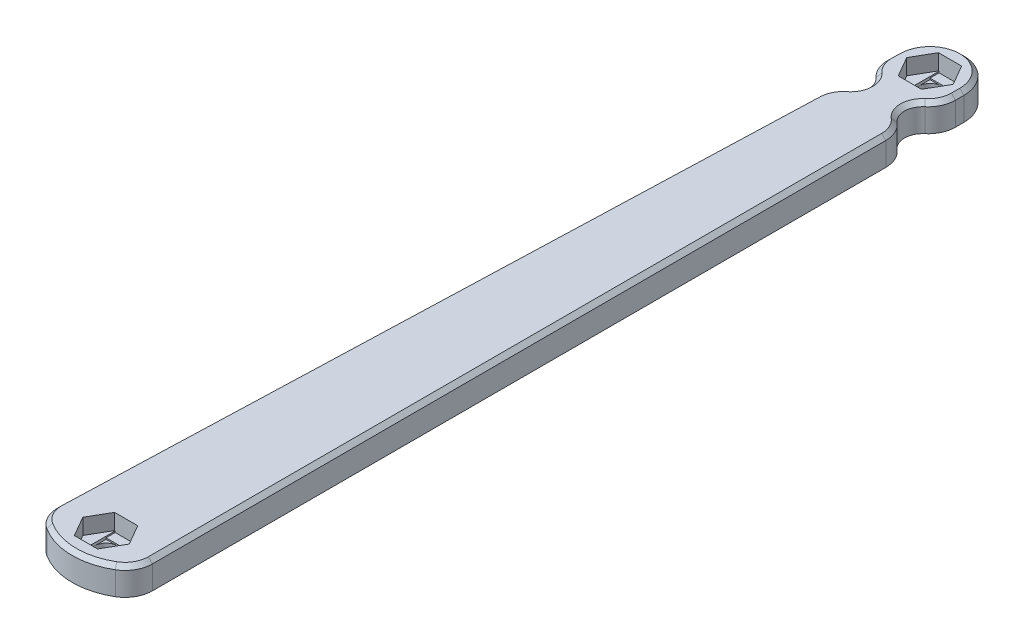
ISO-10303-21;
HEADER;
FILE_DESCRIPTION(('STEP AP214'),'2;1');
FILE_NAME('part.step','',(''),(''),'','','');
FILE_SCHEMA(('AUTOMOTIVE_DESIGN { 1 0 10303 214 1 1 1 1 }'));
ENDSEC;
DATA;
#1=APPLICATION_CONTEXT('core data for automotive mechanical design processes');
#2=APPLICATION_PROTOCOL_DEFINITION('international standard','automotive_design',2000,#1);
#3=PRODUCT_CONTEXT('',#1,'mechanical');
#4=PRODUCT('Part','Part','',(#3));
#5=PRODUCT_RELATED_PRODUCT_CATEGORY('part','',(#4));
#6=PRODUCT_DEFINITION_FORMATION('','',#4);
#7=PRODUCT_DEFINITION_CONTEXT('part definition',#1,'design');
#8=PRODUCT_DEFINITION('design','',#6,#7);
#9=PRODUCT_DEFINITION_SHAPE('','',#8);
#10=(LENGTH_UNIT() NAMED_UNIT(*) SI_UNIT(.MILLI.,.METRE.));
#11=(NAMED_UNIT(*) PLANE_ANGLE_UNIT() SI_UNIT($,.RADIAN.));
#12=(NAMED_UNIT(*) SI_UNIT($,.STERADIAN.) SOLID_ANGLE_UNIT());
#13=UNCERTAINTY_MEASURE_WITH_UNIT(LENGTH_MEASURE(1.E-05),#10,'distance_accuracy_value','');
#14=(GEOMETRIC_REPRESENTATION_CONTEXT(3) GLOBAL_UNCERTAINTY_ASSIGNED_CONTEXT((#13)) GLOBAL_UNIT_ASSIGNED_CONTEXT((#10,
#11,#12)) REPRESENTATION_CONTEXT('',''));
#15=CARTESIAN_POINT('',(0.,0.,0.));
#16=DIRECTION('',(0.,0.,1.));
#17=DIRECTION('',(1.,0.,0.));
#18=AXIS2_PLACEMENT_3D('',#15,#16,#17);
#19=CARTESIAN_POINT('',(-7.26679915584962,-3.675,117.87992676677));
#20=DIRECTION('',(0.,1.,0.));
#21=DIRECTION('',(0.,0.,1.));
#22=AXIS2_PLACEMENT_3D('',#19,#20,#21);
#23=CYLINDRICAL_SURFACE('',#22,1.6);
#24=CARTESIAN_POINT('',(-7.26679915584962,1.825,117.87992676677));
#25=DIRECTION('',(0.,-1.,0.));
#26=DIRECTION('',(0.,0.,1.));
#27=AXIS2_PLACEMENT_3D('',#24,#25,#26);
#28=CIRCLE('',#27,1.6);
#29=CARTESIAN_POINT('',(-7.26679915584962,1.825,119.47992676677));
#30=VERTEX_POINT('',#29);
#31=CARTESIAN_POINT('',(-5.66679915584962,1.825,117.87992676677));
#32=VERTEX_POINT('',#31);
#33=EDGE_CURVE('E589',#30,#32,#28,.F.);
#34=ORIENTED_EDGE('',*,*,#33,.T.);
#35=CARTESIAN_POINT('',(-7.26679915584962,1.825,116.27992676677));
#36=VERTEX_POINT('',#35);
#37=EDGE_CURVE('E595',#32,#36,#28,.F.);
#38=ORIENTED_EDGE('',*,*,#37,.T.);
#39=CARTESIAN_POINT('',(-8.86679915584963,1.825,117.87992676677));
#40=VERTEX_POINT('',#39);
#41=EDGE_CURVE('E588',#36,#40,#28,.F.);
#42=ORIENTED_EDGE('',*,*,#41,.T.);
#43=EDGE_CURVE('E586',#40,#30,#28,.F.);
#44=ORIENTED_EDGE('',*,*,#43,.T.);
#45=EDGE_LOOP('',(#34,#38,#42,#44));
#46=FACE_BOUND('',#45,.T.);
#47=CARTESIAN_POINT('',(-7.26679915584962,0.525,117.87992676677));
#48=DIRECTION('',(0.,-1.,0.));
#49=DIRECTION('',(0.,0.,-1.));
#50=AXIS2_PLACEMENT_3D('',#47,#48,#49);
#51=CIRCLE('',#50,1.6);
#52=CARTESIAN_POINT('',(-7.26679915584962,0.525,116.27992676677));
#53=VERTEX_POINT('',#52);
#54=EDGE_CURVE('E1017',#53,#53,#51,.F.);
#55=ORIENTED_EDGE('',*,*,#54,.F.);
#56=EDGE_LOOP('',(#55));
#57=FACE_BOUND('',#56,.T.);
#58=ADVANCED_FACE('F64',(#46,#57),#23,.F.);
#59=CARTESIAN_POINT('',(-0.3,4.525,0.));
#60=DIRECTION('',(1.,0.,0.));
#61=DIRECTION('',(0.,0.,1.));
#62=AXIS2_PLACEMENT_3D('',#59,#60,#61);
#63=PLANE('',#62);
#64=DIRECTION('',(0.,1.,0.));
#65=VECTOR('',#64,1.);
#66=CARTESIAN_POINT('',(-0.299999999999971,4.525,118.091515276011));
#67=LINE('',#66,#65);
#68=CARTESIAN_POINT('',(-0.299999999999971,0.525,118.091515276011));
#69=VERTEX_POINT('',#68);
#70=CARTESIAN_POINT('',(-0.299999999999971,3.925,118.091515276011));
#71=VERTEX_POINT('',#70);
#72=EDGE_CURVE('E443',#69,#71,#67,.T.);
#73=ORIENTED_EDGE('',*,*,#72,.F.);
#74=DIRECTION('',(0.,0.,-1.));
#75=VECTOR('',#74,1.);
#76=CARTESIAN_POINT('',(-0.3,0.525,0.));
#77=LINE('',#76,#75);
#78=CARTESIAN_POINT('',(-0.299999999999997,0.525,11.3727211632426));
#79=VERTEX_POINT('',#78);
#80=EDGE_CURVE('E80',#69,#79,#77,.T.);
#81=ORIENTED_EDGE('',*,*,#80,.T.);
#82=DIRECTION('',(0.,-1.,0.));
#83=VECTOR('',#82,1.);
#84=CARTESIAN_POINT('',(-0.299999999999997,4.525,11.3727211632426));
#85=LINE('',#84,#83);
#86=CARTESIAN_POINT('',(-0.299999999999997,3.925,11.3727211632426));
#87=VERTEX_POINT('',#86);
#88=EDGE_CURVE('E441',#87,#79,#85,.T.);
#89=ORIENTED_EDGE('',*,*,#88,.F.);
#90=DIRECTION('',(0.,0.,-1.));
#91=VECTOR('',#90,1.);
#92=CARTESIAN_POINT('',(-0.3,3.925,0.));
#93=LINE('',#92,#91);
#94=EDGE_CURVE('E522',#71,#87,#93,.T.);
#95=ORIENTED_EDGE('',*,*,#94,.F.);
#96=EDGE_LOOP('',(#73,#81,#89,#95));
#97=FACE_BOUND('',#96,.T.);
#98=ADVANCED_FACE('F868',(#97),#63,.T.);
#99=CARTESIAN_POINT('',(-7.1859565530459,4.525,113.211242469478));
#100=DIRECTION('',(0.,-1.,0.));
#101=DIRECTION('',(0.,0.,-1.));
#102=AXIS2_PLACEMENT_3D('',#99,#100,#101);
#103=CYLINDRICAL_SURFACE('',#102,9.66972732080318);
#104=CARTESIAN_POINT('',(-7.1859565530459,0.525,113.211242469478));
#105=DIRECTION('',(0.,-1.,0.));
#106=DIRECTION('',(0.,0.,-1.));
#107=AXIS2_PLACEMENT_3D('',#104,#105,#106);
#108=CIRCLE('',#107,9.66972732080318);
#109=CARTESIAN_POINT('',(-2.26395389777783,0.525,121.534554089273));
#110=VERTEX_POINT('',#109);
#111=CARTESIAN_POINT('',(-12.3896619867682,0.525,121.361400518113));
#112=VERTEX_POINT('',#111);
#113=EDGE_CURVE('E421',#110,#112,#108,.T.);
#114=ORIENTED_EDGE('',*,*,#113,.F.);
#115=DIRECTION('',(0.,-1.,0.));
#116=VECTOR('',#115,1.);
#117=CARTESIAN_POINT('',(-2.26395389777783,4.525,121.534554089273));
#118=LINE('',#117,#116);
#119=CARTESIAN_POINT('',(-2.26395389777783,3.925,121.534554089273));
#120=VERTEX_POINT('',#119);
#121=EDGE_CURVE('E431',#120,#110,#118,.T.);
#122=ORIENTED_EDGE('',*,*,#121,.F.);
#123=CARTESIAN_POINT('',(-7.1859565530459,3.925,113.211242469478));
#124=DIRECTION('',(0.,-1.,0.));
#125=DIRECTION('',(0.,0.,1.));
#126=AXIS2_PLACEMENT_3D('',#123,#124,#125);
#127=CIRCLE('',#126,9.66972732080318);
#128=CARTESIAN_POINT('',(-12.3896619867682,3.925,121.361400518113));
#129=VERTEX_POINT('',#128);
#130=EDGE_CURVE('E513',#129,#120,#127,.F.);
#131=ORIENTED_EDGE('',*,*,#130,.F.);
#132=DIRECTION('',(0.,-1.,0.));
#133=VECTOR('',#132,1.);
#134=CARTESIAN_POINT('',(-12.3896619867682,4.525,121.361400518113));
#135=LINE('',#134,#133);
#136=EDGE_CURVE('E434',#112,#129,#135,.F.);
#137=ORIENTED_EDGE('',*,*,#136,.F.);
#138=EDGE_LOOP('',(#114,#122,#131,#137));
#139=FACE_BOUND('',#138,.T.);
#140=ADVANCED_FACE('F873',(#139),#103,.T.);
#141=CARTESIAN_POINT('',(-10.1909685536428,4.525,-0.348641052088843));
#142=DIRECTION('',(0.999415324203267,0.,0.0341907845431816));
#143=DIRECTION('',(-0.0341907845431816,0.,0.999415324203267));
#144=AXIS2_PLACEMENT_3D('',#141,#142,#143);
#145=PLANE('',#144);
#146=DIRECTION('',(0.0341907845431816,0.,-0.999415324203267));
#147=VECTOR('',#146,1.);
#148=CARTESIAN_POINT('',(-10.1909685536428,0.525,-0.348641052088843));
#149=LINE('',#148,#147);
#150=CARTESIAN_POINT('',(-14.2347474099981,0.525,117.853225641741));
#151=VERTEX_POINT('',#150);
#152=CARTESIAN_POINT('',(-10.5859481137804,0.525,11.1968274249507));
#153=VERTEX_POINT('',#152);
#154=EDGE_CURVE('E403',#151,#153,#149,.T.);
#155=ORIENTED_EDGE('',*,*,#154,.F.);
#156=DIRECTION('',(0.,-1.,0.));
#157=VECTOR('',#156,1.);
#158=CARTESIAN_POINT('',(-14.2347474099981,4.525,117.853225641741));
#159=LINE('',#158,#157);
#160=CARTESIAN_POINT('',(-14.2347474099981,3.925,117.853225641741));
#161=VERTEX_POINT('',#160);
#162=EDGE_CURVE('E408',#161,#151,#159,.T.);
#163=ORIENTED_EDGE('',*,*,#162,.F.);
#164=DIRECTION('',(-0.0341907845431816,0.,0.999415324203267));
#165=VECTOR('',#164,1.);
#166=CARTESIAN_POINT('',(-14.2347474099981,3.925,117.853225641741));
#167=LINE('',#166,#165);
#168=CARTESIAN_POINT('',(-10.5859481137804,3.925,11.1968274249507));
#169=VERTEX_POINT('',#168);
#170=EDGE_CURVE('E520',#169,#161,#167,.T.);
#171=ORIENTED_EDGE('',*,*,#170,.F.);
#172=DIRECTION('',(0.,1.,0.));
#173=VECTOR('',#172,1.);
#174=CARTESIAN_POINT('',(-10.5859481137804,4.525,11.1968274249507));
#175=LINE('',#174,#173);
#176=EDGE_CURVE('E410',#153,#169,#175,.T.);
#177=ORIENTED_EDGE('',*,*,#176,.F.);
#178=EDGE_LOOP('',(#155,#163,#171,#177));
#179=FACE_BOUND('',#178,.T.);
#180=ADVANCED_FACE('F405',(#179),#145,.F.);
#181=CARTESIAN_POINT('',(-10.237086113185,4.525,117.989988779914));
#182=DIRECTION('',(0.,-1.,0.));
#183=DIRECTION('',(0.,0.,-1.));
#184=AXIS2_PLACEMENT_3D('',#181,#182,#183);
#185=CYLINDRICAL_SURFACE('',#184,4.);
#186=ORIENTED_EDGE('',*,*,#162,.T.);
#187=CARTESIAN_POINT('',(-10.237086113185,0.525,117.989988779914));
#188=DIRECTION('',(0.,-1.,0.));
#189=DIRECTION('',(0.,0.,-1.));
#190=AXIS2_PLACEMENT_3D('',#187,#188,#189);
#191=CIRCLE('',#190,4.);
#192=EDGE_CURVE('E416',#112,#151,#191,.T.);
#193=ORIENTED_EDGE('',*,*,#192,.F.);
#194=ORIENTED_EDGE('',*,*,#136,.T.);
#195=CARTESIAN_POINT('',(-10.237086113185,3.925,117.989988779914));
#196=DIRECTION('',(0.,-1.,0.));
#197=DIRECTION('',(0.,0.,1.));
#198=AXIS2_PLACEMENT_3D('',#195,#196,#197);
#199=CIRCLE('',#198,4.);
#200=EDGE_CURVE('E429',#161,#129,#199,.F.);
#201=ORIENTED_EDGE('',*,*,#200,.F.);
#202=EDGE_LOOP('',(#186,#193,#194,#201));
#203=FACE_BOUND('',#202,.T.);
#204=ADVANCED_FACE('F427',(#203),#185,.T.);
#205=CARTESIAN_POINT('',(-4.29999999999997,4.525,118.091515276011));
#206=DIRECTION('',(0.,-1.,0.));
#207=DIRECTION('',(0.,0.,-1.));
#208=AXIS2_PLACEMENT_3D('',#205,#206,#207);
#209=CYLINDRICAL_SURFACE('',#208,4.);
#210=ORIENTED_EDGE('',*,*,#121,.T.);
#211=CARTESIAN_POINT('',(-4.29999999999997,0.525,118.091515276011));
#212=DIRECTION('',(0.,-1.,0.));
#213=DIRECTION('',(0.,0.,-1.));
#214=AXIS2_PLACEMENT_3D('',#211,#212,#213);
#215=CIRCLE('',#214,4.);
#216=EDGE_CURVE('E424',#69,#110,#215,.T.);
#217=ORIENTED_EDGE('',*,*,#216,.F.);
#218=ORIENTED_EDGE('',*,*,#72,.T.);
#219=CARTESIAN_POINT('',(-4.29999999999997,3.925,118.091515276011));
#220=DIRECTION('',(0.,-1.,0.));
#221=DIRECTION('',(0.,0.,1.));
#222=AXIS2_PLACEMENT_3D('',#219,#220,#221);
#223=CIRCLE('',#222,4.);
#224=EDGE_CURVE('E517',#120,#71,#223,.F.);
#225=ORIENTED_EDGE('',*,*,#224,.F.);
#226=EDGE_LOOP('',(#210,#217,#218,#225));
#227=FACE_BOUND('',#226,.T.);
#228=ADVANCED_FACE('F998',(#227),#209,.T.);
#229=CARTESIAN_POINT('',(-5.24999999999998,-3.15,0.));
#230=DIRECTION('',(0.,1.,0.));
#231=DIRECTION('',(0.,0.,1.));
#232=AXIS2_PLACEMENT_3D('',#229,#230,#231);
#233=CYLINDRICAL_SURFACE('',#232,1.6);
#234=CARTESIAN_POINT('',(-5.24999999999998,1.825,0.));
#235=DIRECTION('',(0.,-1.,0.));
#236=DIRECTION('',(0.,0.,1.));
#237=AXIS2_PLACEMENT_3D('',#234,#235,#236);
#238=CIRCLE('',#237,1.6);
#239=CARTESIAN_POINT('',(-5.24999999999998,1.825,1.6));
#240=VERTEX_POINT('',#239);
#241=CARTESIAN_POINT('',(-3.64999999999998,1.825,0.));
#242=VERTEX_POINT('',#241);
#243=EDGE_CURVE('E13',#240,#242,#238,.F.);
#244=ORIENTED_EDGE('',*,*,#243,.T.);
#245=CARTESIAN_POINT('',(-5.24999999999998,1.825,-1.6));
#246=VERTEX_POINT('',#245);
#247=EDGE_CURVE('E73',#242,#246,#238,.F.);
#248=ORIENTED_EDGE('',*,*,#247,.T.);
#249=CARTESIAN_POINT('',(-6.84999999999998,1.825,0.));
#250=VERTEX_POINT('',#249);
#251=EDGE_CURVE('E598',#246,#250,#238,.F.);
#252=ORIENTED_EDGE('',*,*,#251,.T.);
#253=EDGE_CURVE('E68',#250,#240,#238,.F.);
#254=ORIENTED_EDGE('',*,*,#253,.T.);
#255=EDGE_LOOP('',(#244,#248,#252,#254));
#256=FACE_BOUND('',#255,.T.);
#257=CARTESIAN_POINT('',(-5.24999999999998,0.,0.));
#258=DIRECTION('',(0.,-1.,0.));
#259=DIRECTION('',(0.,0.,-1.));
#260=AXIS2_PLACEMENT_3D('',#257,#258,#259);
#261=CIRCLE('',#260,1.6);
#262=CARTESIAN_POINT('',(-5.24999999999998,0.,-1.6));
#263=VERTEX_POINT('',#262);
#264=EDGE_CURVE('E622',#263,#263,#261,.F.);
#265=ORIENTED_EDGE('',*,*,#264,.F.);
#266=EDGE_LOOP('',(#265));
#267=FACE_BOUND('',#266,.T.);
#268=ADVANCED_FACE('F1571',(#256,#267),#233,.F.);
#269=CARTESIAN_POINT('',(0.,2.225,0.));
#270=DIRECTION('',(0.,1.,0.));
#271=DIRECTION('',(0.,0.,1.));
#272=AXIS2_PLACEMENT_3D('',#269,#270,#271);
#273=PLANE('',#272);
#274=DIRECTION('',(0.,0.,1.));
#275=VECTOR('',#274,1.);
#276=CARTESIAN_POINT('',(-3.64999999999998,2.225,2.925));
#277=LINE('',#276,#275);
#278=CARTESIAN_POINT('',(-3.64999999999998,2.225,-2.925));
#279=VERTEX_POINT('',#278);
#280=CARTESIAN_POINT('',(-3.64999999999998,2.225,2.925));
#281=VERTEX_POINT('',#280);
#282=EDGE_CURVE('E655',#279,#281,#277,.T.);
#283=ORIENTED_EDGE('',*,*,#282,.T.);
#284=DIRECTION('',(-1.,0.,0.));
#285=VECTOR('',#284,1.);
#286=CARTESIAN_POINT('',(-3.56125046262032,2.225,2.925));
#287=LINE('',#286,#285);
#288=CARTESIAN_POINT('',(-3.56125046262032,2.225,2.925));
#289=VERTEX_POINT('',#288);
#290=EDGE_CURVE('E777',#289,#281,#287,.T.);
#291=ORIENTED_EDGE('',*,*,#290,.F.);
#292=DIRECTION('',(-0.499999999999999,0.,0.866025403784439));
#293=VECTOR('',#292,1.);
#294=CARTESIAN_POINT('',(-1.87250092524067,2.225,0.));
#295=LINE('',#294,#293);
#296=CARTESIAN_POINT('',(-1.87250092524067,2.225,0.));
#297=VERTEX_POINT('',#296);
#298=EDGE_CURVE('E794',#297,#289,#295,.T.);
#299=ORIENTED_EDGE('',*,*,#298,.F.);
#300=DIRECTION('',(0.500000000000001,0.,0.866025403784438));
#301=VECTOR('',#300,1.);
#302=CARTESIAN_POINT('',(-3.56125046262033,2.225,-2.925));
#303=LINE('',#302,#301);
#304=CARTESIAN_POINT('',(-3.56125046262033,2.225,-2.925));
#305=VERTEX_POINT('',#304);
#306=EDGE_CURVE('E791',#305,#297,#303,.T.);
#307=ORIENTED_EDGE('',*,*,#306,.F.);
#308=DIRECTION('',(1.,0.,0.));
#309=VECTOR('',#308,1.);
#310=CARTESIAN_POINT('',(-6.93874953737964,2.225,-2.925));
#311=LINE('',#310,#309);
#312=EDGE_CURVE('E787',#279,#305,#311,.T.);
#313=ORIENTED_EDGE('',*,*,#312,.F.);
#314=EDGE_LOOP('',(#283,#291,#299,#307,#313));
#315=FACE_BOUND('',#314,.T.);
#316=ADVANCED_FACE('F862',(#315),#273,.T.);
#317=CARTESIAN_POINT('',(0.,2.225,0.));
#318=DIRECTION('',(0.,1.,0.));
#319=DIRECTION('',(0.,0.,1.));
#320=AXIS2_PLACEMENT_3D('',#317,#318,#319);
#321=PLANE('',#320);
#322=DIRECTION('',(0.,0.,1.));
#323=VECTOR('',#322,1.);
#324=CARTESIAN_POINT('',(-5.66679915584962,2.225,120.80492676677));
#325=LINE('',#324,#323);
#326=CARTESIAN_POINT('',(-5.66679915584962,2.225,114.95492676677));
#327=VERTEX_POINT('',#326);
#328=CARTESIAN_POINT('',(-5.66679915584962,2.225,120.80492676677));
#329=VERTEX_POINT('',#328);
#330=EDGE_CURVE('E685',#327,#329,#325,.T.);
#331=ORIENTED_EDGE('',*,*,#330,.T.);
#332=DIRECTION('',(-1.,0.,0.));
#333=VECTOR('',#332,1.);
#334=CARTESIAN_POINT('',(-5.57804961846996,2.225,120.80492676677));
#335=LINE('',#334,#333);
#336=CARTESIAN_POINT('',(-5.57804961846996,2.225,120.80492676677));
#337=VERTEX_POINT('',#336);
#338=EDGE_CURVE('E743',#337,#329,#335,.T.);
#339=ORIENTED_EDGE('',*,*,#338,.F.);
#340=DIRECTION('',(-0.499999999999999,0.,0.866025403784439));
#341=VECTOR('',#340,1.);
#342=CARTESIAN_POINT('',(-3.88930008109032,2.225,117.87992676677));
#343=LINE('',#342,#341);
#344=CARTESIAN_POINT('',(-3.88930008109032,2.225,117.87992676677));
#345=VERTEX_POINT('',#344);
#346=EDGE_CURVE('E739',#345,#337,#343,.T.);
#347=ORIENTED_EDGE('',*,*,#346,.F.);
#348=DIRECTION('',(0.500000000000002,0.,0.866025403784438));
#349=VECTOR('',#348,1.);
#350=CARTESIAN_POINT('',(-5.57804961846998,2.225,114.95492676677));
#351=LINE('',#350,#349);
#352=CARTESIAN_POINT('',(-5.57804961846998,2.225,114.95492676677));
#353=VERTEX_POINT('',#352);
#354=EDGE_CURVE('E736',#353,#345,#351,.T.);
#355=ORIENTED_EDGE('',*,*,#354,.F.);
#356=DIRECTION('',(1.,0.,0.));
#357=VECTOR('',#356,1.);
#358=CARTESIAN_POINT('',(-8.95554869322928,2.225,114.95492676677));
#359=LINE('',#358,#357);
#360=EDGE_CURVE('E732',#327,#353,#359,.T.);
#361=ORIENTED_EDGE('',*,*,#360,.F.);
#362=EDGE_LOOP('',(#331,#339,#347,#355,#361));
#363=FACE_BOUND('',#362,.T.);
#364=ADVANCED_FACE('F853',(#363),#321,.T.);
#365=CARTESIAN_POINT('',(-5.24999999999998,0.525,0.));
#366=DIRECTION('',(0.,-1.,0.));
#367=DIRECTION('',(0.,0.,-1.));
#368=AXIS2_PLACEMENT_3D('',#365,#366,#367);
#369=CYLINDRICAL_SURFACE('',#368,3.675);
#370=CARTESIAN_POINT('',(-5.24999999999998,0.525,0.));
#371=DIRECTION('',(0.,-1.,0.));
#372=DIRECTION('',(0.,0.,1.));
#373=AXIS2_PLACEMENT_3D('',#370,#371,#372);
#374=CIRCLE('',#373,3.675);
#375=CARTESIAN_POINT('',(-5.24999999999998,0.525,3.675));
#376=VERTEX_POINT('',#375);
#377=EDGE_CURVE('E436',#376,#376,#374,.T.);
#378=ORIENTED_EDGE('',*,*,#377,.T.);
#379=EDGE_LOOP('',(#378));
#380=FACE_BOUND('',#379,.T.);
#381=CARTESIAN_POINT('',(-5.24999999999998,0.,0.));
#382=DIRECTION('',(0.,-1.,0.));
#383=DIRECTION('',(0.,0.,1.));
#384=AXIS2_PLACEMENT_3D('',#381,#382,#383);
#385=CIRCLE('',#384,3.675);
#386=CARTESIAN_POINT('',(-5.24999999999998,0.,3.675));
#387=VERTEX_POINT('',#386);
#388=EDGE_CURVE('E843',#387,#387,#385,.T.);
#389=ORIENTED_EDGE('',*,*,#388,.F.);
#390=EDGE_LOOP('',(#389));
#391=FACE_BOUND('',#390,.T.);
#392=ADVANCED_FACE('F851',(#380,#391),#369,.T.);
#393=CARTESIAN_POINT('',(0.,0.,0.));
#394=DIRECTION('',(0.,1.,0.));
#395=DIRECTION('',(0.,0.,1.));
#396=AXIS2_PLACEMENT_3D('',#393,#394,#395);
#397=PLANE('',#396);
#398=ORIENTED_EDGE('',*,*,#388,.T.);
#399=EDGE_LOOP('',(#398));
#400=FACE_BOUND('',#399,.T.);
#401=ORIENTED_EDGE('',*,*,#264,.T.);
#402=EDGE_LOOP('',(#401));
#403=FACE_BOUND('',#402,.T.);
#404=ADVANCED_FACE('F848',(#400,#403),#397,.F.);
#405=CARTESIAN_POINT('',(-5.24999999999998,4.525,0.));
#406=DIRECTION('',(0.,1.,0.));
#407=DIRECTION('',(0.,0.,1.));
#408=AXIS2_PLACEMENT_3D('',#405,#406,#407);
#409=PLANE('',#408);
#410=CARTESIAN_POINT('',(-4.29999999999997,4.525,118.091515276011));
#411=DIRECTION('',(0.,-1.,0.));
#412=DIRECTION('',(0.,0.,1.));
#413=AXIS2_PLACEMENT_3D('',#410,#411,#412);
#414=CIRCLE('',#413,3.4);
#415=CARTESIAN_POINT('',(-0.899999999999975,4.525,118.091515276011));
#416=VERTEX_POINT('',#415);
#417=CARTESIAN_POINT('',(-2.56936081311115,4.525,121.018098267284));
#418=VERTEX_POINT('',#417);
#419=EDGE_CURVE('E504',#416,#418,#414,.T.);
#420=ORIENTED_EDGE('',*,*,#419,.F.);
#421=DIRECTION('',(0.,0.,1.));
#422=VECTOR('',#421,1.);
#423=CARTESIAN_POINT('',(-0.900000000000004,4.525,0.));
#424=LINE('',#423,#422);
#425=CARTESIAN_POINT('',(-0.900000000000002,4.525,11.3727211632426));
#426=VERTEX_POINT('',#425);
#427=EDGE_CURVE('E498',#426,#416,#424,.T.);
#428=ORIENTED_EDGE('',*,*,#427,.F.);
#429=CARTESIAN_POINT('',(-4.3,4.525,11.3727211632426));
#430=DIRECTION('',(0.,-1.,0.));
#431=DIRECTION('',(0.,0.,1.));
#432=AXIS2_PLACEMENT_3D('',#429,#430,#431);
#433=CIRCLE('',#432,3.4);
#434=CARTESIAN_POINT('',(-2.10150375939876,4.525,8.77914944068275));
#435=VERTEX_POINT('',#434);
#436=EDGE_CURVE('E492',#435,#426,#433,.T.);
#437=ORIENTED_EDGE('',*,*,#436,.F.);
#438=CARTESIAN_POINT('',(0.,4.525,6.3));
#439=DIRECTION('',(0.,-1.,0.));
#440=DIRECTION('',(0.,0.,1.));
#441=AXIS2_PLACEMENT_3D('',#438,#439,#440);
#442=CIRCLE('',#441,3.25000000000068);
#443=CARTESIAN_POINT('',(-2.10150375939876,4.525,3.82085055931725));
#444=VERTEX_POINT('',#443);
#445=EDGE_CURVE('E486',#444,#435,#442,.F.);
#446=ORIENTED_EDGE('',*,*,#445,.F.);
#447=CARTESIAN_POINT('',(-4.3,4.525,1.22727883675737));
#448=DIRECTION('',(0.,-1.,0.));
#449=DIRECTION('',(0.,0.,1.));
#450=AXIS2_PLACEMENT_3D('',#447,#448,#449);
#451=CIRCLE('',#450,3.4);
#452=CARTESIAN_POINT('',(-0.900000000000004,4.525,1.22727883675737));
#453=VERTEX_POINT('',#452);
#454=EDGE_CURVE('E480',#453,#444,#451,.T.);
#455=ORIENTED_EDGE('',*,*,#454,.F.);
#456=DIRECTION('',(0.,0.,1.));
#457=VECTOR('',#456,1.);
#458=CARTESIAN_POINT('',(-0.900000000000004,4.525,0.));
#459=LINE('',#458,#457);
#460=CARTESIAN_POINT('',(-0.90000000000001,4.525,0.));
#461=VERTEX_POINT('',#460);
#462=EDGE_CURVE('E474',#461,#453,#459,.T.);
#463=ORIENTED_EDGE('',*,*,#462,.F.);
#464=CARTESIAN_POINT('',(-5.24999999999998,4.525,0.));
#465=DIRECTION('',(0.,-1.,0.));
#466=DIRECTION('',(0.,0.,1.));
#467=AXIS2_PLACEMENT_3D('',#464,#465,#466);
#468=CIRCLE('',#467,4.34999999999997);
#469=CARTESIAN_POINT('',(-9.59745666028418,4.525,-0.148729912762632));
#470=VERTEX_POINT('',#469);
#471=EDGE_CURVE('E471',#470,#461,#468,.T.);
#472=ORIENTED_EDGE('',*,*,#471,.F.);
#473=DIRECTION('',(0.0341907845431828,0.,-0.999415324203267));
#474=VECTOR('',#473,1.);
#475=CARTESIAN_POINT('',(-9.59745666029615,4.525,-0.148729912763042));
#476=LINE('',#475,#474);
#477=CARTESIAN_POINT('',(-9.63941828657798,4.525,1.07783136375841));
#478=VERTEX_POINT('',#477);
#479=EDGE_CURVE('E477',#478,#470,#476,.T.);
#480=ORIENTED_EDGE('',*,*,#479,.F.);
#481=CARTESIAN_POINT('',(-6.24140618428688,4.525,1.19408003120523));
#482=DIRECTION('',(0.,-1.,0.));
#483=DIRECTION('',(0.,0.,1.));
#484=AXIS2_PLACEMENT_3D('',#481,#482,#483);
#485=CIRCLE('',#484,3.4);
#486=CARTESIAN_POINT('',(-8.52729326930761,4.525,3.71096704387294));
#487=VERTEX_POINT('',#486);
#488=EDGE_CURVE('E483',#487,#478,#485,.T.);
#489=ORIENTED_EDGE('',*,*,#488,.F.);
#490=CARTESIAN_POINT('',(-10.7123323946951,4.525,6.11681492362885));
#491=DIRECTION('',(0.,-1.,0.));
#492=DIRECTION('',(0.,0.,1.));
#493=AXIS2_PLACEMENT_3D('',#490,#491,#492);
#494=CIRCLE('',#493,3.25);
#495=CARTESIAN_POINT('',(-8.6968213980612,4.525,8.66636692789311));
#496=VERTEX_POINT('',#495);
#497=EDGE_CURVE('E489',#496,#487,#494,.F.);
#498=ORIENTED_EDGE('',*,*,#497,.F.);
#499=CARTESIAN_POINT('',(-6.5882868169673,4.525,11.3335905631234));
#500=DIRECTION('',(0.,-1.,0.));
#501=DIRECTION('',(0.,0.,1.));
#502=AXIS2_PLACEMENT_3D('',#499,#500,#501);
#503=CIRCLE('',#502,3.39999999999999);
#504=CARTESIAN_POINT('',(-9.9862989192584,4.525,11.2173418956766));
#505=VERTEX_POINT('',#504);
#506=EDGE_CURVE('E495',#505,#496,#503,.T.);
#507=ORIENTED_EDGE('',*,*,#506,.F.);
#508=DIRECTION('',(0.0341907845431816,0.,-0.999415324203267));
#509=VECTOR('',#508,1.);
#510=CARTESIAN_POINT('',(-9.9862989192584,4.525,11.2173418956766));
#511=LINE('',#510,#509);
#512=CARTESIAN_POINT('',(-13.6350982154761,4.525,117.873740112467));
#513=VERTEX_POINT('',#512);
#514=EDGE_CURVE('E501',#513,#505,#511,.T.);
#515=ORIENTED_EDGE('',*,*,#514,.F.);
#516=CARTESIAN_POINT('',(-10.237086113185,4.525,117.989988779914));
#517=DIRECTION('',(0.,-1.,0.));
#518=DIRECTION('',(0.,0.,1.));
#519=AXIS2_PLACEMENT_3D('',#516,#517,#518);
#520=CIRCLE('',#519,3.39999999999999);
#521=CARTESIAN_POINT('',(-12.0667756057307,4.525,120.855688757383));
#522=VERTEX_POINT('',#521);
#523=EDGE_CURVE('E507',#522,#513,#520,.T.);
#524=ORIENTED_EDGE('',*,*,#523,.F.);
#525=CARTESIAN_POINT('',(-7.1859565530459,4.525,113.211242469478));
#526=DIRECTION('',(0.,-1.,0.));
#527=DIRECTION('',(0.,0.,1.));
#528=AXIS2_PLACEMENT_3D('',#525,#526,#527);
#529=CIRCLE('',#528,9.06972732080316);
#530=EDGE_CURVE('E510',#418,#522,#529,.T.);
#531=ORIENTED_EDGE('',*,*,#530,.F.);
#532=EDGE_LOOP('',(#420,#428,#437,#446,#455,#463,#472,#480,#489,#498,#507,#515,#524,#531));
#533=FACE_BOUND('',#532,.T.);
#534=DIRECTION('',(-0.5,0.,-0.866025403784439));
#535=VECTOR('',#534,1.);
#536=CARTESIAN_POINT('',(-8.95554869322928,4.525,120.80492676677));
#537=LINE('',#536,#535);
#538=CARTESIAN_POINT('',(-8.95554869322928,4.525,120.80492676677));
#539=VERTEX_POINT('',#538);
#540=CARTESIAN_POINT('',(-10.6442982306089,4.525,117.87992676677));
#541=VERTEX_POINT('',#540);
#542=EDGE_CURVE('E747',#539,#541,#537,.T.);
#543=ORIENTED_EDGE('',*,*,#542,.T.);
#544=DIRECTION('',(0.499999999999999,0.,-0.866025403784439));
#545=VECTOR('',#544,1.);
#546=CARTESIAN_POINT('',(-10.6442982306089,4.525,117.87992676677));
#547=LINE('',#546,#545);
#548=CARTESIAN_POINT('',(-8.95554869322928,4.525,114.95492676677));
#549=VERTEX_POINT('',#548);
#550=EDGE_CURVE('E750',#541,#549,#547,.T.);
#551=ORIENTED_EDGE('',*,*,#550,.T.);
#552=DIRECTION('',(1.,0.,0.));
#553=VECTOR('',#552,1.);
#554=CARTESIAN_POINT('',(-8.95554869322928,4.525,114.95492676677));
#555=LINE('',#554,#553);
#556=CARTESIAN_POINT('',(-5.57804961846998,4.525,114.95492676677));
#557=VERTEX_POINT('',#556);
#558=EDGE_CURVE('E754',#549,#557,#555,.T.);
#559=ORIENTED_EDGE('',*,*,#558,.T.);
#560=DIRECTION('',(0.500000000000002,0.,0.866025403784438));
#561=VECTOR('',#560,1.);
#562=CARTESIAN_POINT('',(-5.57804961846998,4.525,114.95492676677));
#563=LINE('',#562,#561);
#564=CARTESIAN_POINT('',(-3.88930008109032,4.525,117.87992676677));
#565=VERTEX_POINT('',#564);
#566=EDGE_CURVE('E757',#557,#565,#563,.T.);
#567=ORIENTED_EDGE('',*,*,#566,.T.);
#568=DIRECTION('',(-0.499999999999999,0.,0.866025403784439));
#569=VECTOR('',#568,1.);
#570=CARTESIAN_POINT('',(-3.88930008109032,4.525,117.87992676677));
#571=LINE('',#570,#569);
#572=CARTESIAN_POINT('',(-5.57804961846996,4.525,120.80492676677));
#573=VERTEX_POINT('',#572);
#574=EDGE_CURVE('E760',#565,#573,#571,.T.);
#575=ORIENTED_EDGE('',*,*,#574,.T.);
#576=DIRECTION('',(-1.,0.,0.));
#577=VECTOR('',#576,1.);
#578=CARTESIAN_POINT('',(-5.57804961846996,4.525,120.80492676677));
#579=LINE('',#578,#577);
#580=EDGE_CURVE('E730',#573,#539,#579,.T.);
#581=ORIENTED_EDGE('',*,*,#580,.T.);
#582=EDGE_LOOP('',(#543,#551,#559,#567,#575,#581));
#583=FACE_BOUND('',#582,.T.);
#584=DIRECTION('',(-1.,0.,0.));
#585=VECTOR('',#584,1.);
#586=CARTESIAN_POINT('',(-3.56125046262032,4.525,2.925));
#587=LINE('',#586,#585);
#588=CARTESIAN_POINT('',(-3.56125046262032,4.525,2.925));
#589=VERTEX_POINT('',#588);
#590=CARTESIAN_POINT('',(-6.93874953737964,4.525,2.925));
#591=VERTEX_POINT('',#590);
#592=EDGE_CURVE('E583',#589,#591,#587,.T.);
#593=ORIENTED_EDGE('',*,*,#592,.T.);
#594=DIRECTION('',(-0.500000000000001,0.,-0.866025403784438));
#595=VECTOR('',#594,1.);
#596=CARTESIAN_POINT('',(-6.93874953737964,4.525,2.925));
#597=LINE('',#596,#595);
#598=CARTESIAN_POINT('',(-8.62749907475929,4.525,0.));
#599=VERTEX_POINT('',#598);
#600=EDGE_CURVE('E800',#591,#599,#597,.T.);
#601=ORIENTED_EDGE('',*,*,#600,.T.);
#602=DIRECTION('',(0.499999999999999,0.,-0.866025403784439));
#603=VECTOR('',#602,1.);
#604=CARTESIAN_POINT('',(-8.62749907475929,4.525,0.));
#605=LINE('',#604,#603);
#606=CARTESIAN_POINT('',(-6.93874953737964,4.525,-2.925));
#607=VERTEX_POINT('',#606);
#608=EDGE_CURVE('E803',#599,#607,#605,.T.);
#609=ORIENTED_EDGE('',*,*,#608,.T.);
#610=DIRECTION('',(1.,0.,0.));
#611=VECTOR('',#610,1.);
#612=CARTESIAN_POINT('',(-6.93874953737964,4.525,-2.925));
#613=LINE('',#612,#611);
#614=CARTESIAN_POINT('',(-3.56125046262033,4.525,-2.925));
#615=VERTEX_POINT('',#614);
#616=EDGE_CURVE('E806',#607,#615,#613,.T.);
#617=ORIENTED_EDGE('',*,*,#616,.T.);
#618=DIRECTION('',(0.500000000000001,0.,0.866025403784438));
#619=VECTOR('',#618,1.);
#620=CARTESIAN_POINT('',(-3.56125046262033,4.525,-2.925));
#621=LINE('',#620,#619);
#622=CARTESIAN_POINT('',(-1.87250092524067,4.525,0.));
#623=VERTEX_POINT('',#622);
#624=EDGE_CURVE('E809',#615,#623,#621,.T.);
#625=ORIENTED_EDGE('',*,*,#624,.T.);
#626=DIRECTION('',(-0.499999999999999,0.,0.866025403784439));
#627=VECTOR('',#626,1.);
#628=CARTESIAN_POINT('',(-1.87250092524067,4.525,0.));
#629=LINE('',#628,#627);
#630=EDGE_CURVE('E812',#623,#589,#629,.T.);
#631=ORIENTED_EDGE('',*,*,#630,.T.);
#632=EDGE_LOOP('',(#593,#601,#609,#617,#625,#631));
#633=FACE_BOUND('',#632,.T.);
#634=ADVANCED_FACE('F860',(#533,#583,#633),#409,.T.);
#635=CARTESIAN_POINT('',(-5.24999999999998,0.525,0.));
#636=DIRECTION('',(0.,1.,0.));
#637=DIRECTION('',(0.,0.,1.));
#638=AXIS2_PLACEMENT_3D('',#635,#636,#637);
#639=PLANE('',#638);
#640=CARTESIAN_POINT('',(-9.34218087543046,0.525,91.8143340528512));
#641=DIRECTION('',(0.,1.,0.));
#642=DIRECTION('',(0.,0.,-1.));
#643=AXIS2_PLACEMENT_3D('',#640,#641,#642);
#644=CIRCLE('',#643,2.5);
#645=CARTESIAN_POINT('',(-9.34218087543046,0.525,89.3143340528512));
#646=VERTEX_POINT('',#645);
#647=EDGE_CURVE('E710',#646,#646,#644,.T.);
#648=ORIENTED_EDGE('',*,*,#647,.T.);
#649=EDGE_LOOP('',(#648));
#650=FACE_BOUND('',#649,.T.);
#651=CARTESIAN_POINT('',(-7.05873836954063,0.525,100.232046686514));
#652=DIRECTION('',(0.,1.,0.));
#653=DIRECTION('',(0.,0.,-1.));
#654=AXIS2_PLACEMENT_3D('',#651,#652,#653);
#655=CIRCLE('',#654,2.5);
#656=CARTESIAN_POINT('',(-7.05873836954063,0.525,97.7320466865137));
#657=VERTEX_POINT('',#656);
#658=EDGE_CURVE('E716',#657,#657,#655,.T.);
#659=ORIENTED_EDGE('',*,*,#658,.T.);
#660=EDGE_LOOP('',(#659));
#661=FACE_BOUND('',#660,.T.);
#662=CARTESIAN_POINT('',(-4.30087752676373,0.525,108.506477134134));
#663=DIRECTION('',(0.,1.,0.));
#664=DIRECTION('',(0.,0.,-1.));
#665=AXIS2_PLACEMENT_3D('',#662,#663,#664);
#666=CIRCLE('',#665,2.5);
#667=CARTESIAN_POINT('',(-4.30087752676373,0.525,106.006477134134));
#668=VERTEX_POINT('',#667);
#669=EDGE_CURVE('E675',#668,#668,#666,.T.);
#670=ORIENTED_EDGE('',*,*,#669,.T.);
#671=EDGE_LOOP('',(#670));
#672=FACE_BOUND('',#671,.T.);
#673=ORIENTED_EDGE('',*,*,#377,.F.);
#674=EDGE_LOOP('',(#673));
#675=FACE_BOUND('',#674,.T.);
#676=CARTESIAN_POINT('',(-10.7123323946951,0.525,6.11681492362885));
#677=DIRECTION('',(0.,-1.,0.));
#678=DIRECTION('',(0.,0.,1.));
#679=AXIS2_PLACEMENT_3D('',#676,#677,#678);
#680=CIRCLE('',#679,2.65);
#681=CARTESIAN_POINT('',(-8.93068510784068,0.525,4.15512357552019));
#682=VERTEX_POINT('',#681);
#683=CARTESIAN_POINT('',(-9.0689157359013,0.525,8.19568040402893));
#684=VERTEX_POINT('',#683);
#685=EDGE_CURVE('E413',#682,#684,#680,.T.);
#686=ORIENTED_EDGE('',*,*,#685,.F.);
#687=CARTESIAN_POINT('',(-6.24140618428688,0.525,1.19408003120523));
#688=DIRECTION('',(0.,-1.,0.));
#689=DIRECTION('',(0.,0.,1.));
#690=AXIS2_PLACEMENT_3D('',#687,#688,#689);
#691=CIRCLE('',#690,4.);
#692=CARTESIAN_POINT('',(-10.2390674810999,0.525,1.0573168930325));
#693=VERTEX_POINT('',#692);
#694=EDGE_CURVE('E453',#693,#682,#691,.F.);
#695=ORIENTED_EDGE('',*,*,#694,.F.);
#696=DIRECTION('',(0.0341907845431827,0.,-0.999415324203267));
#697=VECTOR('',#696,1.);
#698=CARTESIAN_POINT('',(-10.1909685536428,0.525,-0.348641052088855));
#699=LINE('',#698,#697);
#700=CARTESIAN_POINT('',(-10.1971058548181,0.525,-0.169244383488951));
#701=VERTEX_POINT('',#700);
#702=EDGE_CURVE('E836',#693,#701,#699,.T.);
#703=ORIENTED_EDGE('',*,*,#702,.T.);
#704=CARTESIAN_POINT('',(-5.24999999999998,0.525,0.));
#705=DIRECTION('',(0.,-1.,0.));
#706=DIRECTION('',(0.,0.,1.));
#707=AXIS2_PLACEMENT_3D('',#704,#705,#706);
#708=CIRCLE('',#707,4.94999999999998);
#709=CARTESIAN_POINT('',(-0.3,0.525,0.));
#710=VERTEX_POINT('',#709);
#711=EDGE_CURVE('E767',#701,#710,#708,.T.);
#712=ORIENTED_EDGE('',*,*,#711,.T.);
#713=DIRECTION('',(0.,0.,-1.));
#714=VECTOR('',#713,1.);
#715=CARTESIAN_POINT('',(-0.3,0.525,0.));
#716=LINE('',#715,#714);
#717=CARTESIAN_POINT('',(-0.3,0.525,1.22727883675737));
#718=VERTEX_POINT('',#717);
#719=EDGE_CURVE('E827',#718,#710,#716,.T.);
#720=ORIENTED_EDGE('',*,*,#719,.F.);
#721=CARTESIAN_POINT('',(-4.3,0.525,1.22727883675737));
#722=DIRECTION('',(0.,-1.,0.));
#723=DIRECTION('',(0.,0.,1.));
#724=AXIS2_PLACEMENT_3D('',#721,#722,#723);
#725=CIRCLE('',#724,4.);
#726=CARTESIAN_POINT('',(-1.71353383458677,0.525,4.27853968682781));
#727=VERTEX_POINT('',#726);
#728=EDGE_CURVE('E450',#727,#718,#725,.F.);
#729=ORIENTED_EDGE('',*,*,#728,.F.);
#730=CARTESIAN_POINT('',(0.,0.525,6.3));
#731=DIRECTION('',(0.,-1.,0.));
#732=DIRECTION('',(0.,0.,1.));
#733=AXIS2_PLACEMENT_3D('',#730,#731,#732);
#734=CIRCLE('',#733,2.65000000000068);
#735=CARTESIAN_POINT('',(-1.71353383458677,0.525,8.32146031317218));
#736=VERTEX_POINT('',#735);
#737=EDGE_CURVE('E830',#736,#727,#734,.T.);
#738=ORIENTED_EDGE('',*,*,#737,.F.);
#739=CARTESIAN_POINT('',(-4.3,0.525,11.3727211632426));
#740=DIRECTION('',(0.,-1.,0.));
#741=DIRECTION('',(0.,0.,1.));
#742=AXIS2_PLACEMENT_3D('',#739,#740,#741);
#743=CIRCLE('',#742,4.);
#744=EDGE_CURVE('E456',#79,#736,#743,.F.);
#745=ORIENTED_EDGE('',*,*,#744,.F.);
#746=ORIENTED_EDGE('',*,*,#80,.F.);
#747=ORIENTED_EDGE('',*,*,#216,.T.);
#748=ORIENTED_EDGE('',*,*,#113,.T.);
#749=ORIENTED_EDGE('',*,*,#192,.T.);
#750=ORIENTED_EDGE('',*,*,#154,.T.);
#751=CARTESIAN_POINT('',(-6.5882868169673,0.525,11.3335905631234));
#752=DIRECTION('',(0.,-1.,0.));
#753=DIRECTION('',(0.,0.,1.));
#754=AXIS2_PLACEMENT_3D('',#751,#752,#753);
#755=CIRCLE('',#754,4.);
#756=EDGE_CURVE('E459',#684,#153,#755,.F.);
#757=ORIENTED_EDGE('',*,*,#756,.F.);
#758=EDGE_LOOP('',(#686,#695,#703,#712,#720,#729,#738,#745,#746,#747,#748,#749,#750,#757));
#759=FACE_BOUND('',#758,.T.);
#760=ORIENTED_EDGE('',*,*,#54,.T.);
#761=EDGE_LOOP('',(#760));
#762=FACE_BOUND('',#761,.T.);
#763=ADVANCED_FACE('F418',(#650,#661,#672,#675,#759,#762),#639,.F.);
#764=CARTESIAN_POINT('',(-5.24999999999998,4.525,0.));
#765=DIRECTION('',(0.,-1.,0.));
#766=DIRECTION('',(0.,0.,-1.));
#767=AXIS2_PLACEMENT_3D('',#764,#765,#766);
#768=CYLINDRICAL_SURFACE('',#767,4.94999999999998);
#769=DIRECTION('',(0.,-1.,0.));
#770=VECTOR('',#769,1.);
#771=CARTESIAN_POINT('',(-0.3,4.525,0.));
#772=LINE('',#771,#770);
#773=CARTESIAN_POINT('',(-0.3,3.925,0.));
#774=VERTEX_POINT('',#773);
#775=EDGE_CURVE('E841',#774,#710,#772,.T.);
#776=ORIENTED_EDGE('',*,*,#775,.T.);
#777=ORIENTED_EDGE('',*,*,#711,.F.);
#778=DIRECTION('',(0.,-1.,0.));
#779=VECTOR('',#778,1.);
#780=CARTESIAN_POINT('',(-10.1971058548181,4.525,-0.169244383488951));
#781=LINE('',#780,#779);
#782=CARTESIAN_POINT('',(-10.1971058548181,3.925,-0.169244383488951));
#783=VERTEX_POINT('',#782);
#784=EDGE_CURVE('E839',#783,#701,#781,.T.);
#785=ORIENTED_EDGE('',*,*,#784,.F.);
#786=CARTESIAN_POINT('',(-5.24999999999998,3.925,0.));
#787=DIRECTION('',(0.,-1.,0.));
#788=DIRECTION('',(0.,0.,1.));
#789=AXIS2_PLACEMENT_3D('',#786,#787,#788);
#790=CIRCLE('',#789,4.94999999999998);
#791=EDGE_CURVE('E549',#774,#783,#790,.F.);
#792=ORIENTED_EDGE('',*,*,#791,.F.);
#793=EDGE_LOOP('',(#776,#777,#785,#792));
#794=FACE_BOUND('',#793,.T.);
#795=ADVANCED_FACE('F940',(#794),#768,.T.);
#796=CARTESIAN_POINT('',(-0.3,4.525,0.));
#797=DIRECTION('',(1.,0.,0.));
#798=DIRECTION('',(0.,0.,1.));
#799=AXIS2_PLACEMENT_3D('',#796,#797,#798);
#800=PLANE('',#799);
#801=DIRECTION('',(0.,-1.,0.));
#802=VECTOR('',#801,1.);
#803=CARTESIAN_POINT('',(-0.3,4.525,1.22727883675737));
#804=LINE('',#803,#802);
#805=CARTESIAN_POINT('',(-0.3,3.925,1.22727883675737));
#806=VERTEX_POINT('',#805);
#807=EDGE_CURVE('E468',#718,#806,#804,.F.);
#808=ORIENTED_EDGE('',*,*,#807,.F.);
#809=ORIENTED_EDGE('',*,*,#719,.T.);
#810=ORIENTED_EDGE('',*,*,#775,.F.);
#811=DIRECTION('',(0.,0.,-1.));
#812=VECTOR('',#811,1.);
#813=CARTESIAN_POINT('',(-0.3,3.925,0.));
#814=LINE('',#813,#812);
#815=EDGE_CURVE('E546',#806,#774,#814,.T.);
#816=ORIENTED_EDGE('',*,*,#815,.F.);
#817=EDGE_LOOP('',(#808,#809,#810,#816));
#818=FACE_BOUND('',#817,.T.);
#819=ADVANCED_FACE('F959',(#818),#800,.T.);
#820=CARTESIAN_POINT('',(0.,4.525,6.3));
#821=DIRECTION('',(0.,-1.,0.));
#822=DIRECTION('',(0.,0.,-1.));
#823=AXIS2_PLACEMENT_3D('',#820,#821,#822);
#824=CYLINDRICAL_SURFACE('',#823,2.65000000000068);
#825=DIRECTION('',(0.,-1.,0.));
#826=VECTOR('',#825,1.);
#827=CARTESIAN_POINT('',(-1.71353383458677,4.525,8.32146031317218));
#828=LINE('',#827,#826);
#829=CARTESIAN_POINT('',(-1.71353383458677,3.925,8.32146031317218));
#830=VERTEX_POINT('',#829);
#831=EDGE_CURVE('E463',#736,#830,#828,.F.);
#832=ORIENTED_EDGE('',*,*,#831,.F.);
#833=ORIENTED_EDGE('',*,*,#737,.T.);
#834=DIRECTION('',(0.,-1.,0.));
#835=VECTOR('',#834,1.);
#836=CARTESIAN_POINT('',(-1.71353383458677,4.525,4.27853968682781));
#837=LINE('',#836,#835);
#838=CARTESIAN_POINT('',(-1.71353383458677,3.925,4.27853968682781));
#839=VERTEX_POINT('',#838);
#840=EDGE_CURVE('E461',#839,#727,#837,.T.);
#841=ORIENTED_EDGE('',*,*,#840,.F.);
#842=CARTESIAN_POINT('',(0.,3.925,6.3));
#843=DIRECTION('',(0.,-1.,0.));
#844=DIRECTION('',(0.,0.,1.));
#845=AXIS2_PLACEMENT_3D('',#842,#843,#844);
#846=CIRCLE('',#845,2.65000000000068);
#847=EDGE_CURVE('E534',#830,#839,#846,.T.);
#848=ORIENTED_EDGE('',*,*,#847,.F.);
#849=EDGE_LOOP('',(#832,#833,#841,#848));
#850=FACE_BOUND('',#849,.T.);
#851=ADVANCED_FACE('F950',(#850),#824,.F.);
#852=CARTESIAN_POINT('',(-10.7123323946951,4.525,6.11681492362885));
#853=DIRECTION('',(0.,-1.,0.));
#854=DIRECTION('',(0.,0.,-1.));
#855=AXIS2_PLACEMENT_3D('',#852,#853,#854);
#856=CYLINDRICAL_SURFACE('',#855,2.65);
#857=DIRECTION('',(0.,-1.,0.));
#858=VECTOR('',#857,1.);
#859=CARTESIAN_POINT('',(-8.93068510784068,4.525,4.15512357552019));
#860=LINE('',#859,#858);
#861=CARTESIAN_POINT('',(-8.93068510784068,3.925,4.15512357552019));
#862=VERTEX_POINT('',#861);
#863=EDGE_CURVE('E445',#682,#862,#860,.F.);
#864=ORIENTED_EDGE('',*,*,#863,.F.);
#865=ORIENTED_EDGE('',*,*,#685,.T.);
#866=DIRECTION('',(0.,-1.,0.));
#867=VECTOR('',#866,1.);
#868=CARTESIAN_POINT('',(-9.0689157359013,4.525,8.19568040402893));
#869=LINE('',#868,#867);
#870=CARTESIAN_POINT('',(-9.0689157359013,3.925,8.19568040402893));
#871=VERTEX_POINT('',#870);
#872=EDGE_CURVE('E448',#871,#684,#869,.T.);
#873=ORIENTED_EDGE('',*,*,#872,.F.);
#874=CARTESIAN_POINT('',(-10.7123323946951,3.925,6.11681492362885));
#875=DIRECTION('',(0.,-1.,0.));
#876=DIRECTION('',(0.,0.,1.));
#877=AXIS2_PLACEMENT_3D('',#874,#875,#876);
#878=CIRCLE('',#877,2.65);
#879=EDGE_CURVE('E531',#862,#871,#878,.T.);
#880=ORIENTED_EDGE('',*,*,#879,.F.);
#881=EDGE_LOOP('',(#864,#865,#873,#880));
#882=FACE_BOUND('',#881,.T.);
#883=ADVANCED_FACE('F946',(#882),#856,.F.);
#884=CARTESIAN_POINT('',(-10.1909685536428,4.525,-0.348641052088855));
#885=DIRECTION('',(0.999415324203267,0.,0.0341907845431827));
#886=DIRECTION('',(-0.0341907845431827,0.,0.999415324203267));
#887=AXIS2_PLACEMENT_3D('',#884,#885,#886);
#888=PLANE('',#887);
#889=ORIENTED_EDGE('',*,*,#784,.T.);
#890=ORIENTED_EDGE('',*,*,#702,.F.);
#891=DIRECTION('',(0.,1.,0.));
#892=VECTOR('',#891,1.);
#893=CARTESIAN_POINT('',(-10.2390674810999,0.525,1.0573168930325));
#894=LINE('',#893,#892);
#895=CARTESIAN_POINT('',(-10.2390674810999,3.925,1.0573168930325));
#896=VERTEX_POINT('',#895);
#897=EDGE_CURVE('E466',#896,#693,#894,.F.);
#898=ORIENTED_EDGE('',*,*,#897,.F.);
#899=DIRECTION('',(-0.0341907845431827,0.,0.999415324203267));
#900=VECTOR('',#899,1.);
#901=CARTESIAN_POINT('',(-10.2390674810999,3.925,1.0573168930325));
#902=LINE('',#901,#900);
#903=EDGE_CURVE('E543',#783,#896,#902,.T.);
#904=ORIENTED_EDGE('',*,*,#903,.F.);
#905=EDGE_LOOP('',(#889,#890,#898,#904));
#906=FACE_BOUND('',#905,.T.);
#907=ADVANCED_FACE('F942',(#906),#888,.F.);
#908=CARTESIAN_POINT('',(-6.5882868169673,4.525,11.3335905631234));
#909=DIRECTION('',(0.,-1.,0.));
#910=DIRECTION('',(0.,0.,-1.));
#911=AXIS2_PLACEMENT_3D('',#908,#909,#910);
#912=CYLINDRICAL_SURFACE('',#911,4.);
#913=ORIENTED_EDGE('',*,*,#872,.T.);
#914=ORIENTED_EDGE('',*,*,#756,.T.);
#915=ORIENTED_EDGE('',*,*,#176,.T.);
#916=CARTESIAN_POINT('',(-6.5882868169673,3.925,11.3335905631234));
#917=DIRECTION('',(0.,-1.,0.));
#918=DIRECTION('',(0.,0.,1.));
#919=AXIS2_PLACEMENT_3D('',#916,#917,#918);
#920=CIRCLE('',#919,4.);
#921=EDGE_CURVE('E525',#871,#169,#920,.F.);
#922=ORIENTED_EDGE('',*,*,#921,.F.);
#923=EDGE_LOOP('',(#913,#914,#915,#922));
#924=FACE_BOUND('',#923,.T.);
#925=ADVANCED_FACE('F945',(#924),#912,.T.);
#926=CARTESIAN_POINT('',(-4.3,4.525,11.3727211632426));
#927=DIRECTION('',(0.,-1.,0.));
#928=DIRECTION('',(0.,0.,-1.));
#929=AXIS2_PLACEMENT_3D('',#926,#927,#928);
#930=CYLINDRICAL_SURFACE('',#929,4.);
#931=ORIENTED_EDGE('',*,*,#88,.T.);
#932=ORIENTED_EDGE('',*,*,#744,.T.);
#933=ORIENTED_EDGE('',*,*,#831,.T.);
#934=CARTESIAN_POINT('',(-4.3,3.925,11.3727211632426));
#935=DIRECTION('',(0.,-1.,0.));
#936=DIRECTION('',(0.,0.,1.));
#937=AXIS2_PLACEMENT_3D('',#934,#935,#936);
#938=CIRCLE('',#937,4.);
#939=EDGE_CURVE('E528',#87,#830,#938,.F.);
#940=ORIENTED_EDGE('',*,*,#939,.F.);
#941=EDGE_LOOP('',(#931,#932,#933,#940));
#942=FACE_BOUND('',#941,.T.);
#943=ADVANCED_FACE('F992',(#942),#930,.T.);
#944=CARTESIAN_POINT('',(-6.24140618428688,4.525,1.19408003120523));
#945=DIRECTION('',(0.,-1.,0.));
#946=DIRECTION('',(0.,0.,-1.));
#947=AXIS2_PLACEMENT_3D('',#944,#945,#946);
#948=CYLINDRICAL_SURFACE('',#947,4.);
#949=ORIENTED_EDGE('',*,*,#897,.T.);
#950=ORIENTED_EDGE('',*,*,#694,.T.);
#951=ORIENTED_EDGE('',*,*,#863,.T.);
#952=CARTESIAN_POINT('',(-6.24140618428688,3.925,1.19408003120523));
#953=DIRECTION('',(0.,-1.,0.));
#954=DIRECTION('',(0.,0.,1.));
#955=AXIS2_PLACEMENT_3D('',#952,#953,#954);
#956=CIRCLE('',#955,4.);
#957=EDGE_CURVE('E537',#896,#862,#956,.F.);
#958=ORIENTED_EDGE('',*,*,#957,.F.);
#959=EDGE_LOOP('',(#949,#950,#951,#958));
#960=FACE_BOUND('',#959,.T.);
#961=ADVANCED_FACE('F1489',(#960),#948,.T.);
#962=CARTESIAN_POINT('',(-4.3,4.525,1.22727883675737));
#963=DIRECTION('',(0.,-1.,0.));
#964=DIRECTION('',(0.,0.,-1.));
#965=AXIS2_PLACEMENT_3D('',#962,#963,#964);
#966=CYLINDRICAL_SURFACE('',#965,4.);
#967=ORIENTED_EDGE('',*,*,#840,.T.);
#968=ORIENTED_EDGE('',*,*,#728,.T.);
#969=ORIENTED_EDGE('',*,*,#807,.T.);
#970=CARTESIAN_POINT('',(-4.3,3.925,1.22727883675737));
#971=DIRECTION('',(0.,-1.,0.));
#972=DIRECTION('',(0.,0.,1.));
#973=AXIS2_PLACEMENT_3D('',#970,#971,#972);
#974=CIRCLE('',#973,4.);
#975=EDGE_CURVE('E540',#839,#806,#974,.F.);
#976=ORIENTED_EDGE('',*,*,#975,.F.);
#977=EDGE_LOOP('',(#967,#968,#969,#976));
#978=FACE_BOUND('',#977,.T.);
#979=ADVANCED_FACE('F911',(#978),#966,.T.);
#980=DIRECTION('',(0.,0.,-1.));
#981=VECTOR('',#980,1.);
#982=CARTESIAN_POINT('',(-6.84999999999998,2.225,2.925));
#983=LINE('',#982,#981);
#984=CARTESIAN_POINT('',(-6.84999999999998,2.225,2.925));
#985=VERTEX_POINT('',#984);
#986=CARTESIAN_POINT('',(-6.84999999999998,2.225,-2.925));
#987=VERTEX_POINT('',#986);
#988=EDGE_CURVE('E667',#985,#987,#983,.T.);
#989=ORIENTED_EDGE('',*,*,#988,.T.);
#990=CARTESIAN_POINT('',(-6.93874953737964,2.225,-2.925));
#991=VERTEX_POINT('',#990);
#992=EDGE_CURVE('E788',#991,#987,#311,.T.);
#993=ORIENTED_EDGE('',*,*,#992,.F.);
#994=DIRECTION('',(0.499999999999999,0.,-0.866025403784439));
#995=VECTOR('',#994,1.);
#996=CARTESIAN_POINT('',(-8.62749907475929,2.225,0.));
#997=LINE('',#996,#995);
#998=CARTESIAN_POINT('',(-8.62749907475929,2.225,0.));
#999=VERTEX_POINT('',#998);
#1000=EDGE_CURVE('E784',#999,#991,#997,.T.);
#1001=ORIENTED_EDGE('',*,*,#1000,.F.);
#1002=DIRECTION('',(-0.500000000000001,0.,-0.866025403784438));
#1003=VECTOR('',#1002,1.);
#1004=CARTESIAN_POINT('',(-6.93874953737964,2.225,2.925));
#1005=LINE('',#1004,#1003);
#1006=CARTESIAN_POINT('',(-6.93874953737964,2.225,2.925));
#1007=VERTEX_POINT('',#1006);
#1008=EDGE_CURVE('E780',#1007,#999,#1005,.T.);
#1009=ORIENTED_EDGE('',*,*,#1008,.F.);
#1010=EDGE_CURVE('E781',#985,#1007,#287,.T.);
#1011=ORIENTED_EDGE('',*,*,#1010,.F.);
#1012=EDGE_LOOP('',(#989,#993,#1001,#1009,#1011));
#1013=FACE_BOUND('',#1012,.T.);
#1014=ADVANCED_FACE('F907',(#1013),#273,.T.);
#1015=CARTESIAN_POINT('',(-3.56125046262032,2.225,2.925));
#1016=DIRECTION('',(0.,0.,1.));
#1017=DIRECTION('',(-1.,0.,0.));
#1018=AXIS2_PLACEMENT_3D('',#1015,#1016,#1017);
#1019=PLANE('',#1018);
#1020=ORIENTED_EDGE('',*,*,#592,.F.);
#1021=DIRECTION('',(0.,1.,0.));
#1022=VECTOR('',#1021,1.);
#1023=CARTESIAN_POINT('',(-3.56125046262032,2.225,2.925));
#1024=LINE('',#1023,#1022);
#1025=EDGE_CURVE('E751',#289,#589,#1024,.T.);
#1026=ORIENTED_EDGE('',*,*,#1025,.F.);
#1027=ORIENTED_EDGE('',*,*,#290,.T.);
#1028=DIRECTION('',(0.,1.,0.));
#1029=VECTOR('',#1028,1.);
#1030=CARTESIAN_POINT('',(-3.64999999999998,2.025,2.925));
#1031=LINE('',#1030,#1029);
#1032=CARTESIAN_POINT('',(-3.64999999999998,2.025,2.925));
#1033=VERTEX_POINT('',#1032);
#1034=EDGE_CURVE('E673',#1033,#281,#1031,.T.);
#1035=ORIENTED_EDGE('',*,*,#1034,.F.);
#1036=DIRECTION('',(-1.,0.,0.));
#1037=VECTOR('',#1036,1.);
#1038=CARTESIAN_POINT('',(-3.64999999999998,2.025,2.925));
#1039=LINE('',#1038,#1037);
#1040=CARTESIAN_POINT('',(-6.84999999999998,2.025,2.925));
#1041=VERTEX_POINT('',#1040);
#1042=EDGE_CURVE('E651',#1033,#1041,#1039,.T.);
#1043=ORIENTED_EDGE('',*,*,#1042,.T.);
#1044=DIRECTION('',(0.,1.,0.));
#1045=VECTOR('',#1044,1.);
#1046=CARTESIAN_POINT('',(-6.84999999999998,2.025,2.925));
#1047=LINE('',#1046,#1045);
#1048=EDGE_CURVE('E666',#1041,#985,#1047,.T.);
#1049=ORIENTED_EDGE('',*,*,#1048,.T.);
#1050=ORIENTED_EDGE('',*,*,#1010,.T.);
#1051=DIRECTION('',(0.,1.,0.));
#1052=VECTOR('',#1051,1.);
#1053=CARTESIAN_POINT('',(-6.93874953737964,2.225,2.925));
#1054=LINE('',#1053,#1052);
#1055=EDGE_CURVE('E797',#1007,#591,#1054,.T.);
#1056=ORIENTED_EDGE('',*,*,#1055,.T.);
#1057=EDGE_LOOP('',(#1020,#1026,#1027,#1035,#1043,#1049,#1050,#1056));
#1058=FACE_BOUND('',#1057,.T.);
#1059=ADVANCED_FACE('F910',(#1058),#1019,.F.);
#1060=CARTESIAN_POINT('',(-1.87250092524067,2.225,0.));
#1061=DIRECTION('',(0.866025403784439,0.,0.499999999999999));
#1062=DIRECTION('',(-0.499999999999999,0.,0.866025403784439));
#1063=AXIS2_PLACEMENT_3D('',#1060,#1061,#1062);
#1064=PLANE('',#1063);
#1065=ORIENTED_EDGE('',*,*,#630,.F.);
#1066=DIRECTION('',(0.,1.,0.));
#1067=VECTOR('',#1066,1.);
#1068=CARTESIAN_POINT('',(-1.87250092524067,2.225,0.));
#1069=LINE('',#1068,#1067);
#1070=EDGE_CURVE('E816',#297,#623,#1069,.T.);
#1071=ORIENTED_EDGE('',*,*,#1070,.F.);
#1072=ORIENTED_EDGE('',*,*,#298,.T.);
#1073=ORIENTED_EDGE('',*,*,#1025,.T.);
#1074=EDGE_LOOP('',(#1065,#1071,#1072,#1073));
#1075=FACE_BOUND('',#1074,.T.);
#1076=ADVANCED_FACE('F913',(#1075),#1064,.F.);
#1077=CARTESIAN_POINT('',(-3.56125046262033,2.225,-2.925));
#1078=DIRECTION('',(0.866025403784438,0.,-0.500000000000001));
#1079=DIRECTION('',(0.500000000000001,0.,0.866025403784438));
#1080=AXIS2_PLACEMENT_3D('',#1077,#1078,#1079);
#1081=PLANE('',#1080);
#1082=ORIENTED_EDGE('',*,*,#624,.F.);
#1083=DIRECTION('',(0.,1.,0.));
#1084=VECTOR('',#1083,1.);
#1085=CARTESIAN_POINT('',(-3.56125046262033,2.225,-2.925));
#1086=LINE('',#1085,#1084);
#1087=EDGE_CURVE('E818',#305,#615,#1086,.T.);
#1088=ORIENTED_EDGE('',*,*,#1087,.F.);
#1089=ORIENTED_EDGE('',*,*,#306,.T.);
#1090=ORIENTED_EDGE('',*,*,#1070,.T.);
#1091=EDGE_LOOP('',(#1082,#1088,#1089,#1090));
#1092=FACE_BOUND('',#1091,.T.);
#1093=ADVANCED_FACE('F916',(#1092),#1081,.F.);
#1094=CARTESIAN_POINT('',(-6.93874953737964,2.225,-2.925));
#1095=DIRECTION('',(0.,0.,-1.));
#1096=DIRECTION('',(1.,0.,0.));
#1097=AXIS2_PLACEMENT_3D('',#1094,#1095,#1096);
#1098=PLANE('',#1097);
#1099=ORIENTED_EDGE('',*,*,#616,.F.);
#1100=DIRECTION('',(0.,1.,0.));
#1101=VECTOR('',#1100,1.);
#1102=CARTESIAN_POINT('',(-6.93874953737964,2.225,-2.925));
#1103=LINE('',#1102,#1101);
#1104=EDGE_CURVE('E820',#991,#607,#1103,.T.);
#1105=ORIENTED_EDGE('',*,*,#1104,.F.);
#1106=ORIENTED_EDGE('',*,*,#992,.T.);
#1107=DIRECTION('',(0.,1.,0.));
#1108=VECTOR('',#1107,1.);
#1109=CARTESIAN_POINT('',(-6.84999999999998,2.025,-2.925));
#1110=LINE('',#1109,#1108);
#1111=CARTESIAN_POINT('',(-6.84999999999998,2.025,-2.925));
#1112=VERTEX_POINT('',#1111);
#1113=EDGE_CURVE('E678',#1112,#987,#1110,.T.);
#1114=ORIENTED_EDGE('',*,*,#1113,.F.);
#1115=DIRECTION('',(1.,0.,0.));
#1116=VECTOR('',#1115,1.);
#1117=CARTESIAN_POINT('',(-3.64999999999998,2.025,-2.925));
#1118=LINE('',#1117,#1116);
#1119=CARTESIAN_POINT('',(-3.64999999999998,2.025,-2.925));
#1120=VERTEX_POINT('',#1119);
#1121=EDGE_CURVE('E659',#1112,#1120,#1118,.T.);
#1122=ORIENTED_EDGE('',*,*,#1121,.T.);
#1123=DIRECTION('',(0.,1.,0.));
#1124=VECTOR('',#1123,1.);
#1125=CARTESIAN_POINT('',(-3.64999999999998,2.025,-2.925));
#1126=LINE('',#1125,#1124);
#1127=EDGE_CURVE('E676',#1120,#279,#1126,.T.);
#1128=ORIENTED_EDGE('',*,*,#1127,.T.);
#1129=ORIENTED_EDGE('',*,*,#312,.T.);
#1130=ORIENTED_EDGE('',*,*,#1087,.T.);
#1131=EDGE_LOOP('',(#1099,#1105,#1106,#1114,#1122,#1128,#1129,#1130));
#1132=FACE_BOUND('',#1131,.T.);
#1133=ADVANCED_FACE('F920',(#1132),#1098,.F.);
#1134=CARTESIAN_POINT('',(-8.62749907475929,2.225,0.));
#1135=DIRECTION('',(-0.866025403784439,0.,-0.499999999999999));
#1136=DIRECTION('',(0.499999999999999,0.,-0.866025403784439));
#1137=AXIS2_PLACEMENT_3D('',#1134,#1135,#1136);
#1138=PLANE('',#1137);
#1139=ORIENTED_EDGE('',*,*,#608,.F.);
#1140=DIRECTION('',(0.,1.,0.));
#1141=VECTOR('',#1140,1.);
#1142=CARTESIAN_POINT('',(-8.62749907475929,2.225,0.));
#1143=LINE('',#1142,#1141);
#1144=EDGE_CURVE('E822',#999,#599,#1143,.T.);
#1145=ORIENTED_EDGE('',*,*,#1144,.F.);
#1146=ORIENTED_EDGE('',*,*,#1000,.T.);
#1147=ORIENTED_EDGE('',*,*,#1104,.T.);
#1148=EDGE_LOOP('',(#1139,#1145,#1146,#1147));
#1149=FACE_BOUND('',#1148,.T.);
#1150=ADVANCED_FACE('F924',(#1149),#1138,.F.);
#1151=CARTESIAN_POINT('',(-6.93874953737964,2.225,2.925));
#1152=DIRECTION('',(-0.866025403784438,0.,0.500000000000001));
#1153=DIRECTION('',(-0.500000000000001,0.,-0.866025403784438));
#1154=AXIS2_PLACEMENT_3D('',#1151,#1152,#1153);
#1155=PLANE('',#1154);
#1156=ORIENTED_EDGE('',*,*,#600,.F.);
#1157=ORIENTED_EDGE('',*,*,#1055,.F.);
#1158=ORIENTED_EDGE('',*,*,#1008,.T.);
#1159=ORIENTED_EDGE('',*,*,#1144,.T.);
#1160=EDGE_LOOP('',(#1156,#1157,#1158,#1159));
#1161=FACE_BOUND('',#1160,.T.);
#1162=ADVANCED_FACE('F905',(#1161),#1155,.F.);
#1163=CARTESIAN_POINT('',(-8.95554869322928,2.225,120.80492676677));
#1164=DIRECTION('',(-0.866025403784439,0.,0.5));
#1165=DIRECTION('',(-0.5,0.,-0.866025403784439));
#1166=AXIS2_PLACEMENT_3D('',#1163,#1164,#1165);
#1167=PLANE('',#1166);
#1168=ORIENTED_EDGE('',*,*,#542,.F.);
#1169=DIRECTION('',(0.,1.,0.));
#1170=VECTOR('',#1169,1.);
#1171=CARTESIAN_POINT('',(-8.95554869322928,2.225,120.80492676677));
#1172=LINE('',#1171,#1170);
#1173=CARTESIAN_POINT('',(-8.95554869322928,2.225,120.80492676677));
#1174=VERTEX_POINT('',#1173);
#1175=EDGE_CURVE('E765',#1174,#539,#1172,.T.);
#1176=ORIENTED_EDGE('',*,*,#1175,.F.);
#1177=DIRECTION('',(-0.5,0.,-0.866025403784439));
#1178=VECTOR('',#1177,1.);
#1179=CARTESIAN_POINT('',(-8.95554869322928,2.225,120.80492676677));
#1180=LINE('',#1179,#1178);
#1181=CARTESIAN_POINT('',(-10.6442982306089,2.225,117.87992676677));
#1182=VERTEX_POINT('',#1181);
#1183=EDGE_CURVE('E726',#1174,#1182,#1180,.T.);
#1184=ORIENTED_EDGE('',*,*,#1183,.T.);
#1185=DIRECTION('',(0.,1.,0.));
#1186=VECTOR('',#1185,1.);
#1187=CARTESIAN_POINT('',(-10.6442982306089,2.225,117.87992676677));
#1188=LINE('',#1187,#1186);
#1189=EDGE_CURVE('E746',#1182,#541,#1188,.T.);
#1190=ORIENTED_EDGE('',*,*,#1189,.T.);
#1191=EDGE_LOOP('',(#1168,#1176,#1184,#1190));
#1192=FACE_BOUND('',#1191,.T.);
#1193=ADVANCED_FACE('F887',(#1192),#1167,.F.);
#1194=CARTESIAN_POINT('',(-5.57804961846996,2.225,120.80492676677));
#1195=DIRECTION('',(0.,0.,1.));
#1196=DIRECTION('',(-1.,0.,0.));
#1197=AXIS2_PLACEMENT_3D('',#1194,#1195,#1196);
#1198=PLANE('',#1197);
#1199=ORIENTED_EDGE('',*,*,#580,.F.);
#1200=DIRECTION('',(0.,1.,0.));
#1201=VECTOR('',#1200,1.);
#1202=CARTESIAN_POINT('',(-5.57804961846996,2.225,120.80492676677));
#1203=LINE('',#1202,#1201);
#1204=EDGE_CURVE('E768',#337,#573,#1203,.T.);
#1205=ORIENTED_EDGE('',*,*,#1204,.F.);
#1206=ORIENTED_EDGE('',*,*,#338,.T.);
#1207=DIRECTION('',(0.,1.,0.));
#1208=VECTOR('',#1207,1.);
#1209=CARTESIAN_POINT('',(-5.66679915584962,2.025,120.80492676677));
#1210=LINE('',#1209,#1208);
#1211=CARTESIAN_POINT('',(-5.66679915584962,2.025,120.80492676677));
#1212=VERTEX_POINT('',#1211);
#1213=EDGE_CURVE('E670',#1212,#329,#1210,.T.);
#1214=ORIENTED_EDGE('',*,*,#1213,.F.);
#1215=DIRECTION('',(-1.,0.,0.));
#1216=VECTOR('',#1215,1.);
#1217=CARTESIAN_POINT('',(-5.66679915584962,2.025,120.80492676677));
#1218=LINE('',#1217,#1216);
#1219=CARTESIAN_POINT('',(-8.86679915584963,2.025,120.80492676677));
#1220=VERTEX_POINT('',#1219);
#1221=EDGE_CURVE('E681',#1212,#1220,#1218,.T.);
#1222=ORIENTED_EDGE('',*,*,#1221,.T.);
#1223=DIRECTION('',(0.,1.,0.));
#1224=VECTOR('',#1223,1.);
#1225=CARTESIAN_POINT('',(-8.86679915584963,2.025,120.80492676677));
#1226=LINE('',#1225,#1224);
#1227=CARTESIAN_POINT('',(-8.86679915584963,2.225,120.80492676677));
#1228=VERTEX_POINT('',#1227);
#1229=EDGE_CURVE('E696',#1220,#1228,#1226,.T.);
#1230=ORIENTED_EDGE('',*,*,#1229,.T.);
#1231=EDGE_CURVE('E742',#1228,#1174,#335,.T.);
#1232=ORIENTED_EDGE('',*,*,#1231,.T.);
#1233=ORIENTED_EDGE('',*,*,#1175,.T.);
#1234=EDGE_LOOP('',(#1199,#1205,#1206,#1214,#1222,#1230,#1232,#1233));
#1235=FACE_BOUND('',#1234,.T.);
#1236=ADVANCED_FACE('F883',(#1235),#1198,.F.);
#1237=CARTESIAN_POINT('',(-3.88930008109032,2.225,117.87992676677));
#1238=DIRECTION('',(0.866025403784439,0.,0.499999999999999));
#1239=DIRECTION('',(-0.499999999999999,0.,0.866025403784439));
#1240=AXIS2_PLACEMENT_3D('',#1237,#1238,#1239);
#1241=PLANE('',#1240);
#1242=ORIENTED_EDGE('',*,*,#574,.F.);
#1243=DIRECTION('',(0.,1.,0.));
#1244=VECTOR('',#1243,1.);
#1245=CARTESIAN_POINT('',(-3.88930008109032,2.225,117.87992676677));
#1246=LINE('',#1245,#1244);
#1247=EDGE_CURVE('E770',#345,#565,#1246,.T.);
#1248=ORIENTED_EDGE('',*,*,#1247,.F.);
#1249=ORIENTED_EDGE('',*,*,#346,.T.);
#1250=ORIENTED_EDGE('',*,*,#1204,.T.);
#1251=EDGE_LOOP('',(#1242,#1248,#1249,#1250));
#1252=FACE_BOUND('',#1251,.T.);
#1253=ADVANCED_FACE('F886',(#1252),#1241,.F.);
#1254=CARTESIAN_POINT('',(-5.57804961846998,2.225,114.95492676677));
#1255=DIRECTION('',(0.866025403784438,0.,-0.500000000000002));
#1256=DIRECTION('',(0.500000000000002,0.,0.866025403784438));
#1257=AXIS2_PLACEMENT_3D('',#1254,#1255,#1256);
#1258=PLANE('',#1257);
#1259=ORIENTED_EDGE('',*,*,#566,.F.);
#1260=DIRECTION('',(0.,1.,0.));
#1261=VECTOR('',#1260,1.);
#1262=CARTESIAN_POINT('',(-5.57804961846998,2.225,114.95492676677));
#1263=LINE('',#1262,#1261);
#1264=EDGE_CURVE('E772',#353,#557,#1263,.T.);
#1265=ORIENTED_EDGE('',*,*,#1264,.F.);
#1266=ORIENTED_EDGE('',*,*,#354,.T.);
#1267=ORIENTED_EDGE('',*,*,#1247,.T.);
#1268=EDGE_LOOP('',(#1259,#1265,#1266,#1267));
#1269=FACE_BOUND('',#1268,.T.);
#1270=ADVANCED_FACE('F891',(#1269),#1258,.F.);
#1271=CARTESIAN_POINT('',(-8.95554869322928,2.225,114.95492676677));
#1272=DIRECTION('',(0.,0.,-1.));
#1273=DIRECTION('',(1.,0.,0.));
#1274=AXIS2_PLACEMENT_3D('',#1271,#1272,#1273);
#1275=PLANE('',#1274);
#1276=ORIENTED_EDGE('',*,*,#558,.F.);
#1277=DIRECTION('',(0.,1.,0.));
#1278=VECTOR('',#1277,1.);
#1279=CARTESIAN_POINT('',(-8.95554869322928,2.225,114.95492676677));
#1280=LINE('',#1279,#1278);
#1281=CARTESIAN_POINT('',(-8.95554869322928,2.225,114.95492676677));
#1282=VERTEX_POINT('',#1281);
#1283=EDGE_CURVE('E774',#1282,#549,#1280,.T.);
#1284=ORIENTED_EDGE('',*,*,#1283,.F.);
#1285=CARTESIAN_POINT('',(-8.86679915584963,2.225,114.95492676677));
#1286=VERTEX_POINT('',#1285);
#1287=EDGE_CURVE('E733',#1282,#1286,#359,.T.);
#1288=ORIENTED_EDGE('',*,*,#1287,.T.);
#1289=DIRECTION('',(0.,1.,0.));
#1290=VECTOR('',#1289,1.);
#1291=CARTESIAN_POINT('',(-8.86679915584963,2.025,114.95492676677));
#1292=LINE('',#1291,#1290);
#1293=CARTESIAN_POINT('',(-8.86679915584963,2.025,114.95492676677));
#1294=VERTEX_POINT('',#1293);
#1295=EDGE_CURVE('E705',#1294,#1286,#1292,.T.);
#1296=ORIENTED_EDGE('',*,*,#1295,.F.);
#1297=DIRECTION('',(1.,0.,0.));
#1298=VECTOR('',#1297,1.);
#1299=CARTESIAN_POINT('',(-5.66679915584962,2.025,114.95492676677));
#1300=LINE('',#1299,#1298);
#1301=CARTESIAN_POINT('',(-5.66679915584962,2.025,114.95492676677));
#1302=VERTEX_POINT('',#1301);
#1303=EDGE_CURVE('E689',#1294,#1302,#1300,.T.);
#1304=ORIENTED_EDGE('',*,*,#1303,.T.);
#1305=DIRECTION('',(0.,1.,0.));
#1306=VECTOR('',#1305,1.);
#1307=CARTESIAN_POINT('',(-5.66679915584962,2.025,114.95492676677));
#1308=LINE('',#1307,#1306);
#1309=EDGE_CURVE('E703',#1302,#327,#1308,.T.);
#1310=ORIENTED_EDGE('',*,*,#1309,.T.);
#1311=ORIENTED_EDGE('',*,*,#360,.T.);
#1312=ORIENTED_EDGE('',*,*,#1264,.T.);
#1313=EDGE_LOOP('',(#1276,#1284,#1288,#1296,#1304,#1310,#1311,#1312));
#1314=FACE_BOUND('',#1313,.T.);
#1315=ADVANCED_FACE('F895',(#1314),#1275,.F.);
#1316=CARTESIAN_POINT('',(-10.6442982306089,2.225,117.87992676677));
#1317=DIRECTION('',(-0.866025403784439,0.,-0.499999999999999));
#1318=DIRECTION('',(0.499999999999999,0.,-0.866025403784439));
#1319=AXIS2_PLACEMENT_3D('',#1316,#1317,#1318);
#1320=PLANE('',#1319);
#1321=ORIENTED_EDGE('',*,*,#550,.F.);
#1322=ORIENTED_EDGE('',*,*,#1189,.F.);
#1323=DIRECTION('',(0.499999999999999,0.,-0.866025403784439));
#1324=VECTOR('',#1323,1.);
#1325=CARTESIAN_POINT('',(-10.6442982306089,2.225,117.87992676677));
#1326=LINE('',#1325,#1324);
#1327=EDGE_CURVE('E729',#1182,#1282,#1326,.T.);
#1328=ORIENTED_EDGE('',*,*,#1327,.T.);
#1329=ORIENTED_EDGE('',*,*,#1283,.T.);
#1330=EDGE_LOOP('',(#1321,#1322,#1328,#1329));
#1331=FACE_BOUND('',#1330,.T.);
#1332=ADVANCED_FACE('F881',(#1331),#1320,.F.);
#1333=DIRECTION('',(0.,0.,-1.));
#1334=VECTOR('',#1333,1.);
#1335=CARTESIAN_POINT('',(-8.86679915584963,2.225,120.80492676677));
#1336=LINE('',#1335,#1334);
#1337=EDGE_CURVE('E697',#1228,#1286,#1336,.T.);
#1338=ORIENTED_EDGE('',*,*,#1337,.T.);
#1339=ORIENTED_EDGE('',*,*,#1287,.F.);
#1340=ORIENTED_EDGE('',*,*,#1327,.F.);
#1341=ORIENTED_EDGE('',*,*,#1183,.F.);
#1342=ORIENTED_EDGE('',*,*,#1231,.F.);
#1343=EDGE_LOOP('',(#1338,#1339,#1340,#1341,#1342));
#1344=FACE_BOUND('',#1343,.T.);
#1345=ADVANCED_FACE('F865',(#1344),#321,.T.);
#1346=CARTESIAN_POINT('',(-5.24999999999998,4.525,0.));
#1347=DIRECTION('',(0.,-1.,0.));
#1348=DIRECTION('',(0.,0.,-1.));
#1349=AXIS2_PLACEMENT_3D('',#1346,#1347,#1348);
#1350=CONICAL_SURFACE('',#1349,4.34999999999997,0.785398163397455);
#1351=DIRECTION('',(0.706693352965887,0.707106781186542,0.0241765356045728));
#1352=VECTOR('',#1351,1.);
#1353=CARTESIAN_POINT('',(-10.1971058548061,3.925,-0.169244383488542));
#1354=LINE('',#1353,#1352);
#1355=EDGE_CURVE('E579',#783,#470,#1354,.T.);
#1356=ORIENTED_EDGE('',*,*,#1355,.T.);
#1357=ORIENTED_EDGE('',*,*,#471,.T.);
#1358=DIRECTION('',(0.707106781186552,-0.707106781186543,0.));
#1359=VECTOR('',#1358,1.);
#1360=CARTESIAN_POINT('',(-0.90000000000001,4.525,0.));
#1361=LINE('',#1360,#1359);
#1362=EDGE_CURVE('E581',#461,#774,#1361,.T.);
#1363=ORIENTED_EDGE('',*,*,#1362,.T.);
#1364=ORIENTED_EDGE('',*,*,#791,.T.);
#1365=EDGE_LOOP('',(#1356,#1357,#1363,#1364));
#1366=FACE_BOUND('',#1365,.T.);
#1367=ADVANCED_FACE('F66',(#1366),#1350,.T.);
#1368=CARTESIAN_POINT('',(-0.3,3.925,0.));
#1369=DIRECTION('',(-0.707106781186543,-0.707106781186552,0.));
#1370=DIRECTION('',(0.,0.,-1.));
#1371=AXIS2_PLACEMENT_3D('',#1368,#1369,#1370);
#1372=PLANE('',#1371);
#1373=ORIENTED_EDGE('',*,*,#1362,.F.);
#1374=ORIENTED_EDGE('',*,*,#462,.T.);
#1375=DIRECTION('',(0.707106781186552,-0.707106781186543,0.));
#1376=VECTOR('',#1375,1.);
#1377=CARTESIAN_POINT('',(-0.900000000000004,4.525,1.22727883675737));
#1378=LINE('',#1377,#1376);
#1379=EDGE_CURVE('E577',#453,#806,#1378,.T.);
#1380=ORIENTED_EDGE('',*,*,#1379,.T.);
#1381=ORIENTED_EDGE('',*,*,#815,.T.);
#1382=EDGE_LOOP('',(#1373,#1374,#1380,#1381));
#1383=FACE_BOUND('',#1382,.T.);
#1384=ADVANCED_FACE('F984',(#1383),#1372,.F.);
#1385=CARTESIAN_POINT('',(-9.59745666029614,4.525,-0.148729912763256));
#1386=DIRECTION('',(-0.706693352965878,0.707106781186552,-0.0241765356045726));
#1387=DIRECTION('',(-0.0341907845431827,0.,0.999415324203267));
#1388=AXIS2_PLACEMENT_3D('',#1385,#1386,#1387);
#1389=PLANE('',#1388);
#1390=ORIENTED_EDGE('',*,*,#1355,.F.);
#1391=ORIENTED_EDGE('',*,*,#903,.T.);
#1392=DIRECTION('',(0.706693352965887,0.707106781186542,0.0241765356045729));
#1393=VECTOR('',#1392,1.);
#1394=CARTESIAN_POINT('',(-10.2390674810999,3.925,1.0573168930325));
#1395=LINE('',#1394,#1393);
#1396=EDGE_CURVE('E575',#896,#478,#1395,.T.);
#1397=ORIENTED_EDGE('',*,*,#1396,.T.);
#1398=ORIENTED_EDGE('',*,*,#479,.T.);
#1399=EDGE_LOOP('',(#1390,#1391,#1397,#1398));
#1400=FACE_BOUND('',#1399,.T.);
#1401=ADVANCED_FACE('F1369',(#1400),#1389,.T.);
#1402=CARTESIAN_POINT('',(-4.3,4.525,1.22727883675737));
#1403=DIRECTION('',(0.,-1.,0.));
#1404=DIRECTION('',(0.,0.,-1.));
#1405=AXIS2_PLACEMENT_3D('',#1402,#1403,#1404);
#1406=CONICAL_SURFACE('',#1405,3.4,0.785398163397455);
#1407=ORIENTED_EDGE('',*,*,#1379,.F.);
#1408=ORIENTED_EDGE('',*,*,#454,.T.);
#1409=DIRECTION('',(0.457226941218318,-0.707106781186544,0.539391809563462));
#1410=VECTOR('',#1409,1.);
#1411=CARTESIAN_POINT('',(-2.10150375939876,4.525,3.82085055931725));
#1412=LINE('',#1411,#1410);
#1413=EDGE_CURVE('E573',#444,#839,#1412,.T.);
#1414=ORIENTED_EDGE('',*,*,#1413,.T.);
#1415=ORIENTED_EDGE('',*,*,#975,.T.);
#1416=EDGE_LOOP('',(#1407,#1408,#1414,#1415));
#1417=FACE_BOUND('',#1416,.T.);
#1418=ADVANCED_FACE('F1359',(#1417),#1406,.T.);
#1419=CARTESIAN_POINT('',(-6.24140618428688,4.525,1.19408003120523));
#1420=DIRECTION('',(0.,-1.,0.));
#1421=DIRECTION('',(0.,0.,-1.));
#1422=AXIS2_PLACEMENT_3D('',#1419,#1420,#1421);
#1423=CONICAL_SURFACE('',#1422,3.4,0.785398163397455);
#1424=ORIENTED_EDGE('',*,*,#1396,.F.);
#1425=ORIENTED_EDGE('',*,*,#957,.T.);
#1426=DIRECTION('',(0.475401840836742,0.707106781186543,-0.523443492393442));
#1427=VECTOR('',#1426,1.);
#1428=CARTESIAN_POINT('',(-8.93068510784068,3.925,4.15512357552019));
#1429=LINE('',#1428,#1427);
#1430=EDGE_CURVE('E571',#862,#487,#1429,.T.);
#1431=ORIENTED_EDGE('',*,*,#1430,.T.);
#1432=ORIENTED_EDGE('',*,*,#488,.T.);
#1433=EDGE_LOOP('',(#1424,#1425,#1431,#1432));
#1434=FACE_BOUND('',#1433,.T.);
#1435=ADVANCED_FACE('F1349',(#1434),#1423,.T.);
#1436=CARTESIAN_POINT('',(0.,3.925,6.3));
#1437=DIRECTION('',(0.,1.,0.));
#1438=DIRECTION('',(0.,0.,1.));
#1439=AXIS2_PLACEMENT_3D('',#1436,#1437,#1438);
#1440=CONICAL_SURFACE('',#1439,2.65000000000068,0.785398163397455);
#1441=ORIENTED_EDGE('',*,*,#1413,.F.);
#1442=ORIENTED_EDGE('',*,*,#445,.T.);
#1443=DIRECTION('',(0.457226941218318,-0.707106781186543,-0.539391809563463));
#1444=VECTOR('',#1443,1.);
#1445=CARTESIAN_POINT('',(-2.10150375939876,4.525,8.77914944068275));
#1446=LINE('',#1445,#1444);
#1447=EDGE_CURVE('E569',#435,#830,#1446,.T.);
#1448=ORIENTED_EDGE('',*,*,#1447,.T.);
#1449=ORIENTED_EDGE('',*,*,#847,.T.);
#1450=EDGE_LOOP('',(#1441,#1442,#1448,#1449));
#1451=FACE_BOUND('',#1450,.T.);
#1452=ADVANCED_FACE('F1339',(#1451),#1440,.F.);
#1453=CARTESIAN_POINT('',(-10.7123323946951,3.925,6.11681492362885));
#1454=DIRECTION('',(0.,1.,0.));
#1455=DIRECTION('',(0.,0.,1.));
#1456=AXIS2_PLACEMENT_3D('',#1453,#1454,#1455);
#1457=CONICAL_SURFACE('',#1456,2.65,0.785398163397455);
#1458=ORIENTED_EDGE('',*,*,#1430,.F.);
#1459=ORIENTED_EDGE('',*,*,#879,.T.);
#1460=DIRECTION('',(0.438517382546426,0.707106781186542,0.554709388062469));
#1461=VECTOR('',#1460,1.);
#1462=CARTESIAN_POINT('',(-9.0689157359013,3.925,8.19568040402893));
#1463=LINE('',#1462,#1461);
#1464=EDGE_CURVE('E567',#871,#496,#1463,.T.);
#1465=ORIENTED_EDGE('',*,*,#1464,.T.);
#1466=ORIENTED_EDGE('',*,*,#497,.T.);
#1467=EDGE_LOOP('',(#1458,#1459,#1465,#1466));
#1468=FACE_BOUND('',#1467,.T.);
#1469=ADVANCED_FACE('F1329',(#1468),#1457,.F.);
#1470=CARTESIAN_POINT('',(-4.3,4.525,11.3727211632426));
#1471=DIRECTION('',(0.,-1.,0.));
#1472=DIRECTION('',(0.,0.,-1.));
#1473=AXIS2_PLACEMENT_3D('',#1470,#1471,#1472);
#1474=CONICAL_SURFACE('',#1473,3.4,0.785398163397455);
#1475=ORIENTED_EDGE('',*,*,#1447,.F.);
#1476=ORIENTED_EDGE('',*,*,#436,.T.);
#1477=DIRECTION('',(0.707106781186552,-0.707106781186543,0.));
#1478=VECTOR('',#1477,1.);
#1479=CARTESIAN_POINT('',(-0.900000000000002,4.525,11.3727211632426));
#1480=LINE('',#1479,#1478);
#1481=EDGE_CURVE('E565',#426,#87,#1480,.T.);
#1482=ORIENTED_EDGE('',*,*,#1481,.T.);
#1483=ORIENTED_EDGE('',*,*,#939,.T.);
#1484=EDGE_LOOP('',(#1475,#1476,#1482,#1483));
#1485=FACE_BOUND('',#1484,.T.);
#1486=ADVANCED_FACE('F1319',(#1485),#1474,.T.);
#1487=CARTESIAN_POINT('',(-6.5882868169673,4.525,11.3335905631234));
#1488=DIRECTION('',(0.,-1.,0.));
#1489=DIRECTION('',(0.,0.,-1.));
#1490=AXIS2_PLACEMENT_3D('',#1487,#1488,#1489);
#1491=CONICAL_SURFACE('',#1490,3.4,0.785398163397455);
#1492=ORIENTED_EDGE('',*,*,#1464,.F.);
#1493=ORIENTED_EDGE('',*,*,#921,.T.);
#1494=DIRECTION('',(0.706693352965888,0.707106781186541,0.0241765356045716));
#1495=VECTOR('',#1494,1.);
#1496=CARTESIAN_POINT('',(-10.5859481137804,3.925,11.1968274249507));
#1497=LINE('',#1496,#1495);
#1498=EDGE_CURVE('E563',#169,#505,#1497,.T.);
#1499=ORIENTED_EDGE('',*,*,#1498,.T.);
#1500=ORIENTED_EDGE('',*,*,#506,.T.);
#1501=EDGE_LOOP('',(#1492,#1493,#1499,#1500));
#1502=FACE_BOUND('',#1501,.T.);
#1503=ADVANCED_FACE('F1310',(#1502),#1491,.T.);
#1504=CARTESIAN_POINT('',(-0.3,3.925,0.));
#1505=DIRECTION('',(-0.707106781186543,-0.707106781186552,0.));
#1506=DIRECTION('',(0.,0.,-1.));
#1507=AXIS2_PLACEMENT_3D('',#1504,#1505,#1506);
#1508=PLANE('',#1507);
#1509=ORIENTED_EDGE('',*,*,#1481,.F.);
#1510=ORIENTED_EDGE('',*,*,#427,.T.);
#1511=DIRECTION('',(0.707106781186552,-0.707106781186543,0.));
#1512=VECTOR('',#1511,1.);
#1513=CARTESIAN_POINT('',(-0.899999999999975,4.525,118.091515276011));
#1514=LINE('',#1513,#1512);
#1515=EDGE_CURVE('E560',#416,#71,#1514,.T.);
#1516=ORIENTED_EDGE('',*,*,#1515,.T.);
#1517=ORIENTED_EDGE('',*,*,#94,.T.);
#1518=EDGE_LOOP('',(#1509,#1510,#1516,#1517));
#1519=FACE_BOUND('',#1518,.T.);
#1520=ADVANCED_FACE('F1000',(#1519),#1508,.F.);
#1521=CARTESIAN_POINT('',(-9.59745666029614,4.525,-0.148729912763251));
#1522=DIRECTION('',(-0.706693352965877,0.707106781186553,-0.0241765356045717));
#1523=DIRECTION('',(-0.0341907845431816,0.,0.999415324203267));
#1524=AXIS2_PLACEMENT_3D('',#1521,#1522,#1523);
#1525=PLANE('',#1524);
#1526=ORIENTED_EDGE('',*,*,#1498,.F.);
#1527=ORIENTED_EDGE('',*,*,#170,.T.);
#1528=DIRECTION('',(0.706693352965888,0.707106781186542,0.0241765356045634));
#1529=VECTOR('',#1528,1.);
#1530=CARTESIAN_POINT('',(-14.2347474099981,3.925,117.853225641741));
#1531=LINE('',#1530,#1529);
#1532=EDGE_CURVE('E558',#161,#513,#1531,.T.);
#1533=ORIENTED_EDGE('',*,*,#1532,.T.);
#1534=ORIENTED_EDGE('',*,*,#514,.T.);
#1535=EDGE_LOOP('',(#1526,#1527,#1533,#1534));
#1536=FACE_BOUND('',#1535,.T.);
#1537=ADVANCED_FACE('F1292',(#1536),#1525,.T.);
#1538=CARTESIAN_POINT('',(-4.29999999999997,4.525,118.091515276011));
#1539=DIRECTION('',(0.,-1.,0.));
#1540=DIRECTION('',(0.,0.,-1.));
#1541=AXIS2_PLACEMENT_3D('',#1538,#1539,#1540);
#1542=CONICAL_SURFACE('',#1541,3.4,0.785398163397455);
#1543=ORIENTED_EDGE('',*,*,#1515,.F.);
#1544=ORIENTED_EDGE('',*,*,#419,.T.);
#1545=DIRECTION('',(0.359925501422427,-0.707106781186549,0.608649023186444));
#1546=VECTOR('',#1545,1.);
#1547=CARTESIAN_POINT('',(-2.56936081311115,4.525,121.018098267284));
#1548=LINE('',#1547,#1546);
#1549=EDGE_CURVE('E555',#418,#120,#1548,.T.);
#1550=ORIENTED_EDGE('',*,*,#1549,.T.);
#1551=ORIENTED_EDGE('',*,*,#224,.T.);
#1552=EDGE_LOOP('',(#1543,#1544,#1550,#1551));
#1553=FACE_BOUND('',#1552,.T.);
#1554=ADVANCED_FACE('F1004',(#1553),#1542,.T.);
#1555=CARTESIAN_POINT('',(-10.237086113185,4.525,117.989988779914));
#1556=DIRECTION('',(0.,-1.,0.));
#1557=DIRECTION('',(0.,0.,-1.));
#1558=AXIS2_PLACEMENT_3D('',#1555,#1556,#1557);
#1559=CONICAL_SURFACE('',#1558,3.39999999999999,0.785398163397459);
#1560=ORIENTED_EDGE('',*,*,#1532,.F.);
#1561=ORIENTED_EDGE('',*,*,#200,.T.);
#1562=DIRECTION('',(0.38052524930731,0.707106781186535,-0.595987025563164));
#1563=VECTOR('',#1562,1.);
#1564=CARTESIAN_POINT('',(-12.3896619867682,3.925,121.361400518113));
#1565=LINE('',#1564,#1563);
#1566=EDGE_CURVE('E553',#129,#522,#1565,.T.);
#1567=ORIENTED_EDGE('',*,*,#1566,.T.);
#1568=ORIENTED_EDGE('',*,*,#523,.T.);
#1569=EDGE_LOOP('',(#1560,#1561,#1567,#1568));
#1570=FACE_BOUND('',#1569,.T.);
#1571=ADVANCED_FACE('F1016',(#1570),#1559,.T.);
#1572=CARTESIAN_POINT('',(-7.1859565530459,4.525,113.211242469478));
#1573=DIRECTION('',(0.,-1.,0.));
#1574=DIRECTION('',(0.,0.,-1.));
#1575=AXIS2_PLACEMENT_3D('',#1572,#1573,#1574);
#1576=CONICAL_SURFACE('',#1575,9.06972732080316,0.785398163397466);
#1577=ORIENTED_EDGE('',*,*,#1549,.F.);
#1578=ORIENTED_EDGE('',*,*,#530,.T.);
#1579=ORIENTED_EDGE('',*,*,#1566,.F.);
#1580=ORIENTED_EDGE('',*,*,#130,.T.);
#1581=EDGE_LOOP('',(#1577,#1578,#1579,#1580));
#1582=FACE_BOUND('',#1581,.T.);
#1583=ADVANCED_FACE('F1007',(#1582),#1576,.T.);
#1584=CARTESIAN_POINT('',(-5.24999999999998,3.725,0.));
#1585=DIRECTION('',(0.,1.,0.));
#1586=DIRECTION('',(0.,0.,1.));
#1587=AXIS2_PLACEMENT_3D('',#1584,#1585,#1586);
#1588=PLANE('',#1587);
#1589=CARTESIAN_POINT('',(-4.30087752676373,3.725,108.506477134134));
#1590=DIRECTION('',(0.,-1.,0.));
#1591=DIRECTION('',(0.,0.,1.));
#1592=AXIS2_PLACEMENT_3D('',#1589,#1590,#1591);
#1593=CIRCLE('',#1592,2.5);
#1594=CARTESIAN_POINT('',(-4.30087752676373,3.725,111.006477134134));
#1595=VERTEX_POINT('',#1594);
#1596=EDGE_CURVE('E719',#1595,#1595,#1593,.F.);
#1597=ORIENTED_EDGE('',*,*,#1596,.F.);
#1598=EDGE_LOOP('',(#1597));
#1599=FACE_BOUND('',#1598,.T.);
#1600=ADVANCED_FACE('F877',(#1599),#1588,.F.);
#1601=CARTESIAN_POINT('',(-4.30087752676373,11.5960678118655,108.506477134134));
#1602=DIRECTION('',(0.,-1.,0.));
#1603=DIRECTION('',(0.,0.,-1.));
#1604=AXIS2_PLACEMENT_3D('',#1601,#1602,#1603);
#1605=CYLINDRICAL_SURFACE('',#1604,2.5);
#1606=ORIENTED_EDGE('',*,*,#669,.F.);
#1607=EDGE_LOOP('',(#1606));
#1608=FACE_BOUND('',#1607,.T.);
#1609=ORIENTED_EDGE('',*,*,#1596,.T.);
#1610=EDGE_LOOP('',(#1609));
#1611=FACE_BOUND('',#1610,.T.);
#1612=ADVANCED_FACE('F1250',(#1608,#1611),#1605,.F.);
#1613=CARTESIAN_POINT('',(-5.24999999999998,3.725,0.));
#1614=DIRECTION('',(0.,1.,0.));
#1615=DIRECTION('',(0.,0.,1.));
#1616=AXIS2_PLACEMENT_3D('',#1613,#1614,#1615);
#1617=PLANE('',#1616);
#1618=CARTESIAN_POINT('',(-7.05873836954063,3.725,100.232046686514));
#1619=DIRECTION('',(0.,-1.,0.));
#1620=DIRECTION('',(0.,0.,1.));
#1621=AXIS2_PLACEMENT_3D('',#1618,#1619,#1620);
#1622=CIRCLE('',#1621,2.5);
#1623=CARTESIAN_POINT('',(-7.05873836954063,3.725,102.732046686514));
#1624=VERTEX_POINT('',#1623);
#1625=EDGE_CURVE('E713',#1624,#1624,#1622,.F.);
#1626=ORIENTED_EDGE('',*,*,#1625,.F.);
#1627=EDGE_LOOP('',(#1626));
#1628=FACE_BOUND('',#1627,.T.);
#1629=ADVANCED_FACE('F1240',(#1628),#1617,.F.);
#1630=CARTESIAN_POINT('',(-7.05873836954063,11.5960678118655,100.232046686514));
#1631=DIRECTION('',(0.,-1.,0.));
#1632=DIRECTION('',(0.,0.,-1.));
#1633=AXIS2_PLACEMENT_3D('',#1630,#1631,#1632);
#1634=CYLINDRICAL_SURFACE('',#1633,2.5);
#1635=ORIENTED_EDGE('',*,*,#658,.F.);
#1636=EDGE_LOOP('',(#1635));
#1637=FACE_BOUND('',#1636,.T.);
#1638=ORIENTED_EDGE('',*,*,#1625,.T.);
#1639=EDGE_LOOP('',(#1638));
#1640=FACE_BOUND('',#1639,.T.);
#1641=ADVANCED_FACE('F1230',(#1637,#1640),#1634,.F.);
#1642=CARTESIAN_POINT('',(-5.24999999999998,3.725,0.));
#1643=DIRECTION('',(0.,1.,0.));
#1644=DIRECTION('',(0.,0.,1.));
#1645=AXIS2_PLACEMENT_3D('',#1642,#1643,#1644);
#1646=PLANE('',#1645);
#1647=CARTESIAN_POINT('',(-9.34218087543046,3.725,91.8143340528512));
#1648=DIRECTION('',(0.,-1.,0.));
#1649=DIRECTION('',(0.,0.,1.));
#1650=AXIS2_PLACEMENT_3D('',#1647,#1648,#1649);
#1651=CIRCLE('',#1650,2.5);
#1652=CARTESIAN_POINT('',(-9.34218087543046,3.725,94.3143340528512));
#1653=VERTEX_POINT('',#1652);
#1654=EDGE_CURVE('E556',#1653,#1653,#1651,.F.);
#1655=ORIENTED_EDGE('',*,*,#1654,.F.);
#1656=EDGE_LOOP('',(#1655));
#1657=FACE_BOUND('',#1656,.T.);
#1658=ADVANCED_FACE('F1220',(#1657),#1646,.F.);
#1659=CARTESIAN_POINT('',(-9.34218087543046,11.5960678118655,91.8143340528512));
#1660=DIRECTION('',(0.,-1.,0.));
#1661=DIRECTION('',(0.,0.,-1.));
#1662=AXIS2_PLACEMENT_3D('',#1659,#1660,#1661);
#1663=CYLINDRICAL_SURFACE('',#1662,2.5);
#1664=ORIENTED_EDGE('',*,*,#647,.F.);
#1665=EDGE_LOOP('',(#1664));
#1666=FACE_BOUND('',#1665,.T.);
#1667=ORIENTED_EDGE('',*,*,#1654,.T.);
#1668=EDGE_LOOP('',(#1667));
#1669=FACE_BOUND('',#1668,.T.);
#1670=ADVANCED_FACE('F1210',(#1666,#1669),#1663,.F.);
#1671=CARTESIAN_POINT('',(-5.66679915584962,2.025,120.80492676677));
#1672=DIRECTION('',(1.,0.,0.));
#1673=DIRECTION('',(0.,0.,1.));
#1674=AXIS2_PLACEMENT_3D('',#1671,#1672,#1673);
#1675=PLANE('',#1674);
#1676=DIRECTION('',(0.,0.,1.));
#1677=VECTOR('',#1676,1.);
#1678=CARTESIAN_POINT('',(-5.66679915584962,1.825,119.47992676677));
#1679=LINE('',#1678,#1677);
#1680=CARTESIAN_POINT('',(-5.66679915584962,1.825,119.47992676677));
#1681=VERTEX_POINT('',#1680);
#1682=EDGE_CURVE('E1048',#32,#1681,#1679,.T.);
#1683=ORIENTED_EDGE('',*,*,#1682,.T.);
#1684=DIRECTION('',(0.,1.,0.));
#1685=VECTOR('',#1684,1.);
#1686=CARTESIAN_POINT('',(-5.66679915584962,1.825,119.47992676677));
#1687=LINE('',#1686,#1685);
#1688=CARTESIAN_POINT('',(-5.66679915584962,2.025,119.47992676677));
#1689=VERTEX_POINT('',#1688);
#1690=EDGE_CURVE('E637',#1681,#1689,#1687,.T.);
#1691=ORIENTED_EDGE('',*,*,#1690,.T.);
#1692=DIRECTION('',(0.,0.,1.));
#1693=VECTOR('',#1692,1.);
#1694=CARTESIAN_POINT('',(-5.66679915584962,2.025,120.80492676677));
#1695=LINE('',#1694,#1693);
#1696=EDGE_CURVE('E692',#1689,#1212,#1695,.T.);
#1697=ORIENTED_EDGE('',*,*,#1696,.T.);
#1698=ORIENTED_EDGE('',*,*,#1213,.T.);
#1699=ORIENTED_EDGE('',*,*,#330,.F.);
#1700=ORIENTED_EDGE('',*,*,#1309,.F.);
#1701=CARTESIAN_POINT('',(-5.66679915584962,2.025,116.27992676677));
#1702=VERTEX_POINT('',#1701);
#1703=EDGE_CURVE('E693',#1302,#1702,#1695,.T.);
#1704=ORIENTED_EDGE('',*,*,#1703,.T.);
#1705=DIRECTION('',(0.,1.,0.));
#1706=VECTOR('',#1705,1.);
#1707=CARTESIAN_POINT('',(-5.66679915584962,1.825,116.27992676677));
#1708=LINE('',#1707,#1706);
#1709=CARTESIAN_POINT('',(-5.66679915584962,1.825,116.27992676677));
#1710=VERTEX_POINT('',#1709);
#1711=EDGE_CURVE('E642',#1710,#1702,#1708,.T.);
#1712=ORIENTED_EDGE('',*,*,#1711,.F.);
#1713=EDGE_CURVE('E606',#1710,#32,#1679,.T.);
#1714=ORIENTED_EDGE('',*,*,#1713,.T.);
#1715=EDGE_LOOP('',(#1683,#1691,#1697,#1698,#1699,#1700,#1704,#1712,#1714));
#1716=FACE_BOUND('',#1715,.T.);
#1717=ADVANCED_FACE('F1050',(#1716),#1675,.F.);
#1718=CARTESIAN_POINT('',(-8.86679915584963,2.025,120.80492676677));
#1719=DIRECTION('',(-1.,0.,0.));
#1720=DIRECTION('',(0.,0.,-1.));
#1721=AXIS2_PLACEMENT_3D('',#1718,#1719,#1720);
#1722=PLANE('',#1721);
#1723=DIRECTION('',(0.,0.,-1.));
#1724=VECTOR('',#1723,1.);
#1725=CARTESIAN_POINT('',(-8.86679915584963,1.825,119.47992676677));
#1726=LINE('',#1725,#1724);
#1727=CARTESIAN_POINT('',(-8.86679915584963,1.825,116.27992676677));
#1728=VERTEX_POINT('',#1727);
#1729=EDGE_CURVE('E619',#40,#1728,#1726,.T.);
#1730=ORIENTED_EDGE('',*,*,#1729,.T.);
#1731=DIRECTION('',(0.,1.,0.));
#1732=VECTOR('',#1731,1.);
#1733=CARTESIAN_POINT('',(-8.86679915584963,1.825,116.27992676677));
#1734=LINE('',#1733,#1732);
#1735=CARTESIAN_POINT('',(-8.86679915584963,2.025,116.27992676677));
#1736=VERTEX_POINT('',#1735);
#1737=EDGE_CURVE('E641',#1728,#1736,#1734,.T.);
#1738=ORIENTED_EDGE('',*,*,#1737,.T.);
#1739=DIRECTION('',(0.,0.,-1.));
#1740=VECTOR('',#1739,1.);
#1741=CARTESIAN_POINT('',(-8.86679915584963,2.025,120.80492676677));
#1742=LINE('',#1741,#1740);
#1743=EDGE_CURVE('E684',#1736,#1294,#1742,.T.);
#1744=ORIENTED_EDGE('',*,*,#1743,.T.);
#1745=ORIENTED_EDGE('',*,*,#1295,.T.);
#1746=ORIENTED_EDGE('',*,*,#1337,.F.);
#1747=ORIENTED_EDGE('',*,*,#1229,.F.);
#1748=CARTESIAN_POINT('',(-8.86679915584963,2.025,119.47992676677));
#1749=VERTEX_POINT('',#1748);
#1750=EDGE_CURVE('E686',#1220,#1749,#1742,.T.);
#1751=ORIENTED_EDGE('',*,*,#1750,.T.);
#1752=DIRECTION('',(0.,1.,0.));
#1753=VECTOR('',#1752,1.);
#1754=CARTESIAN_POINT('',(-8.86679915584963,1.825,119.47992676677));
#1755=LINE('',#1754,#1753);
#1756=CARTESIAN_POINT('',(-8.86679915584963,1.825,119.47992676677));
#1757=VERTEX_POINT('',#1756);
#1758=EDGE_CURVE('E646',#1757,#1749,#1755,.T.);
#1759=ORIENTED_EDGE('',*,*,#1758,.F.);
#1760=EDGE_CURVE('E612',#1757,#40,#1726,.T.);
#1761=ORIENTED_EDGE('',*,*,#1760,.T.);
#1762=EDGE_LOOP('',(#1730,#1738,#1744,#1745,#1746,#1747,#1751,#1759,#1761));
#1763=FACE_BOUND('',#1762,.T.);
#1764=ADVANCED_FACE('F1192',(#1763),#1722,.F.);
#1765=CARTESIAN_POINT('',(0.,2.025,0.));
#1766=DIRECTION('',(0.,1.,0.));
#1767=DIRECTION('',(0.,0.,1.));
#1768=AXIS2_PLACEMENT_3D('',#1765,#1766,#1767);
#1769=PLANE('',#1768);
#1770=DIRECTION('',(1.,0.,0.));
#1771=VECTOR('',#1770,1.);
#1772=CARTESIAN_POINT('',(0.,2.025,116.27992676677));
#1773=LINE('',#1772,#1771);
#1774=EDGE_CURVE('E585',#1736,#1702,#1773,.T.);
#1775=ORIENTED_EDGE('',*,*,#1774,.T.);
#1776=ORIENTED_EDGE('',*,*,#1703,.F.);
#1777=ORIENTED_EDGE('',*,*,#1303,.F.);
#1778=ORIENTED_EDGE('',*,*,#1743,.F.);
#1779=EDGE_LOOP('',(#1775,#1776,#1777,#1778));
#1780=FACE_BOUND('',#1779,.T.);
#1781=ADVANCED_FACE('F1182',(#1780),#1769,.T.);
#1782=DIRECTION('',(-1.,0.,0.));
#1783=VECTOR('',#1782,1.);
#1784=CARTESIAN_POINT('',(0.,2.025,119.47992676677));
#1785=LINE('',#1784,#1783);
#1786=EDGE_CURVE('E552',#1689,#1749,#1785,.T.);
#1787=ORIENTED_EDGE('',*,*,#1786,.T.);
#1788=ORIENTED_EDGE('',*,*,#1750,.F.);
#1789=ORIENTED_EDGE('',*,*,#1221,.F.);
#1790=ORIENTED_EDGE('',*,*,#1696,.F.);
#1791=EDGE_LOOP('',(#1787,#1788,#1789,#1790));
#1792=FACE_BOUND('',#1791,.T.);
#1793=ADVANCED_FACE('F1173',(#1792),#1769,.T.);
#1794=CARTESIAN_POINT('',(0.,2.025,0.));
#1795=DIRECTION('',(0.,1.,0.));
#1796=DIRECTION('',(0.,0.,1.));
#1797=AXIS2_PLACEMENT_3D('',#1794,#1795,#1796);
#1798=PLANE('',#1797);
#1799=DIRECTION('',(1.,0.,0.));
#1800=VECTOR('',#1799,1.);
#1801=CARTESIAN_POINT('',(-6.84999999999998,2.025,-1.6));
#1802=LINE('',#1801,#1800);
#1803=CARTESIAN_POINT('',(-6.84999999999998,2.025,-1.6));
#1804=VERTEX_POINT('',#1803);
#1805=CARTESIAN_POINT('',(-3.64999999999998,2.025,-1.6));
#1806=VERTEX_POINT('',#1805);
#1807=EDGE_CURVE('E648',#1804,#1806,#1802,.T.);
#1808=ORIENTED_EDGE('',*,*,#1807,.T.);
#1809=DIRECTION('',(0.,0.,1.));
#1810=VECTOR('',#1809,1.);
#1811=CARTESIAN_POINT('',(-3.64999999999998,2.025,2.925));
#1812=LINE('',#1811,#1810);
#1813=EDGE_CURVE('E663',#1120,#1806,#1812,.T.);
#1814=ORIENTED_EDGE('',*,*,#1813,.F.);
#1815=ORIENTED_EDGE('',*,*,#1121,.F.);
#1816=DIRECTION('',(0.,0.,-1.));
#1817=VECTOR('',#1816,1.);
#1818=CARTESIAN_POINT('',(-6.84999999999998,2.025,2.925));
#1819=LINE('',#1818,#1817);
#1820=EDGE_CURVE('E654',#1804,#1112,#1819,.T.);
#1821=ORIENTED_EDGE('',*,*,#1820,.F.);
#1822=EDGE_LOOP('',(#1808,#1814,#1815,#1821));
#1823=FACE_BOUND('',#1822,.T.);
#1824=ADVANCED_FACE('F1163',(#1823),#1798,.T.);
#1825=DIRECTION('',(-1.,0.,0.));
#1826=VECTOR('',#1825,1.);
#1827=CARTESIAN_POINT('',(-6.84999999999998,2.025,1.6));
#1828=LINE('',#1827,#1826);
#1829=CARTESIAN_POINT('',(-3.64999999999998,2.025,1.6));
#1830=VERTEX_POINT('',#1829);
#1831=CARTESIAN_POINT('',(-6.84999999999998,2.025,1.6));
#1832=VERTEX_POINT('',#1831);
#1833=EDGE_CURVE('E1040',#1830,#1832,#1828,.T.);
#1834=ORIENTED_EDGE('',*,*,#1833,.T.);
#1835=EDGE_CURVE('E656',#1041,#1832,#1819,.T.);
#1836=ORIENTED_EDGE('',*,*,#1835,.F.);
#1837=ORIENTED_EDGE('',*,*,#1042,.F.);
#1838=EDGE_CURVE('E662',#1830,#1033,#1812,.T.);
#1839=ORIENTED_EDGE('',*,*,#1838,.F.);
#1840=EDGE_LOOP('',(#1834,#1836,#1837,#1839));
#1841=FACE_BOUND('',#1840,.T.);
#1842=ADVANCED_FACE('F1152',(#1841),#1798,.T.);
#1843=CARTESIAN_POINT('',(-3.64999999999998,2.025,2.925));
#1844=DIRECTION('',(1.,0.,0.));
#1845=DIRECTION('',(0.,0.,1.));
#1846=AXIS2_PLACEMENT_3D('',#1843,#1844,#1845);
#1847=PLANE('',#1846);
#1848=DIRECTION('',(0.,0.,1.));
#1849=VECTOR('',#1848,1.);
#1850=CARTESIAN_POINT('',(-3.64999999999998,1.825,1.6));
#1851=LINE('',#1850,#1849);
#1852=CARTESIAN_POINT('',(-3.64999999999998,1.825,1.6));
#1853=VERTEX_POINT('',#1852);
#1854=EDGE_CURVE('E1030',#242,#1853,#1851,.T.);
#1855=ORIENTED_EDGE('',*,*,#1854,.T.);
#1856=DIRECTION('',(0.,1.,0.));
#1857=VECTOR('',#1856,1.);
#1858=CARTESIAN_POINT('',(-3.64999999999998,1.825,1.6));
#1859=LINE('',#1858,#1857);
#1860=EDGE_CURVE('E1044',#1853,#1830,#1859,.T.);
#1861=ORIENTED_EDGE('',*,*,#1860,.T.);
#1862=ORIENTED_EDGE('',*,*,#1838,.T.);
#1863=ORIENTED_EDGE('',*,*,#1034,.T.);
#1864=ORIENTED_EDGE('',*,*,#282,.F.);
#1865=ORIENTED_EDGE('',*,*,#1127,.F.);
#1866=ORIENTED_EDGE('',*,*,#1813,.T.);
#1867=DIRECTION('',(0.,1.,0.));
#1868=VECTOR('',#1867,1.);
#1869=CARTESIAN_POINT('',(-3.64999999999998,1.825,-1.6));
#1870=LINE('',#1869,#1868);
#1871=CARTESIAN_POINT('',(-3.64999999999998,1.825,-1.6));
#1872=VERTEX_POINT('',#1871);
#1873=EDGE_CURVE('E1046',#1872,#1806,#1870,.T.);
#1874=ORIENTED_EDGE('',*,*,#1873,.F.);
#1875=EDGE_CURVE('E1031',#1872,#242,#1851,.T.);
#1876=ORIENTED_EDGE('',*,*,#1875,.T.);
#1877=EDGE_LOOP('',(#1855,#1861,#1862,#1863,#1864,#1865,#1866,#1874,#1876));
#1878=FACE_BOUND('',#1877,.T.);
#1879=ADVANCED_FACE('F1142',(#1878),#1847,.F.);
#1880=CARTESIAN_POINT('',(-6.84999999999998,2.025,2.925));
#1881=DIRECTION('',(-1.,0.,0.));
#1882=DIRECTION('',(0.,0.,-1.));
#1883=AXIS2_PLACEMENT_3D('',#1880,#1881,#1882);
#1884=PLANE('',#1883);
#1885=DIRECTION('',(0.,0.,-1.));
#1886=VECTOR('',#1885,1.);
#1887=CARTESIAN_POINT('',(-6.84999999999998,1.825,1.6));
#1888=LINE('',#1887,#1886);
#1889=CARTESIAN_POINT('',(-6.84999999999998,1.825,-1.6));
#1890=VERTEX_POINT('',#1889);
#1891=EDGE_CURVE('E1027',#250,#1890,#1888,.T.);
#1892=ORIENTED_EDGE('',*,*,#1891,.T.);
#1893=DIRECTION('',(0.,1.,0.));
#1894=VECTOR('',#1893,1.);
#1895=CARTESIAN_POINT('',(-6.84999999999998,1.825,-1.6));
#1896=LINE('',#1895,#1894);
#1897=EDGE_CURVE('E1037',#1890,#1804,#1896,.T.);
#1898=ORIENTED_EDGE('',*,*,#1897,.T.);
#1899=ORIENTED_EDGE('',*,*,#1820,.T.);
#1900=ORIENTED_EDGE('',*,*,#1113,.T.);
#1901=ORIENTED_EDGE('',*,*,#988,.F.);
#1902=ORIENTED_EDGE('',*,*,#1048,.F.);
#1903=ORIENTED_EDGE('',*,*,#1835,.T.);
#1904=DIRECTION('',(0.,1.,0.));
#1905=VECTOR('',#1904,1.);
#1906=CARTESIAN_POINT('',(-6.84999999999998,1.825,1.6));
#1907=LINE('',#1906,#1905);
#1908=CARTESIAN_POINT('',(-6.84999999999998,1.825,1.6));
#1909=VERTEX_POINT('',#1908);
#1910=EDGE_CURVE('E699',#1909,#1832,#1907,.T.);
#1911=ORIENTED_EDGE('',*,*,#1910,.F.);
#1912=EDGE_CURVE('E88',#1909,#250,#1888,.T.);
#1913=ORIENTED_EDGE('',*,*,#1912,.T.);
#1914=EDGE_LOOP('',(#1892,#1898,#1899,#1900,#1901,#1902,#1903,#1911,#1913));
#1915=FACE_BOUND('',#1914,.T.);
#1916=ADVANCED_FACE('F1133',(#1915),#1884,.F.);
#1917=CARTESIAN_POINT('',(0.,1.825,0.));
#1918=DIRECTION('',(0.,1.,0.));
#1919=DIRECTION('',(0.,0.,1.));
#1920=AXIS2_PLACEMENT_3D('',#1917,#1918,#1919);
#1921=PLANE('',#1920);
#1922=ORIENTED_EDGE('',*,*,#243,.F.);
#1923=DIRECTION('',(-1.,0.,0.));
#1924=VECTOR('',#1923,1.);
#1925=CARTESIAN_POINT('',(-6.84999999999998,1.825,1.6));
#1926=LINE('',#1925,#1924);
#1927=EDGE_CURVE('E1034',#1853,#240,#1926,.T.);
#1928=ORIENTED_EDGE('',*,*,#1927,.F.);
#1929=ORIENTED_EDGE('',*,*,#1854,.F.);
#1930=EDGE_LOOP('',(#1922,#1928,#1929));
#1931=FACE_BOUND('',#1930,.T.);
#1932=ADVANCED_FACE('F1108',(#1931),#1921,.T.);
#1933=ORIENTED_EDGE('',*,*,#247,.F.);
#1934=ORIENTED_EDGE('',*,*,#1875,.F.);
#1935=DIRECTION('',(1.,0.,0.));
#1936=VECTOR('',#1935,1.);
#1937=CARTESIAN_POINT('',(-6.84999999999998,1.825,-1.6));
#1938=LINE('',#1937,#1936);
#1939=EDGE_CURVE('E1026',#246,#1872,#1938,.T.);
#1940=ORIENTED_EDGE('',*,*,#1939,.F.);
#1941=EDGE_LOOP('',(#1933,#1934,#1940));
#1942=FACE_BOUND('',#1941,.T.);
#1943=ADVANCED_FACE('F1116',(#1942),#1921,.T.);
#1944=ORIENTED_EDGE('',*,*,#251,.F.);
#1945=EDGE_CURVE('E1028',#1890,#246,#1938,.T.);
#1946=ORIENTED_EDGE('',*,*,#1945,.F.);
#1947=ORIENTED_EDGE('',*,*,#1891,.F.);
#1948=EDGE_LOOP('',(#1944,#1946,#1947));
#1949=FACE_BOUND('',#1948,.T.);
#1950=ADVANCED_FACE('F1105',(#1949),#1921,.T.);
#1951=ORIENTED_EDGE('',*,*,#253,.F.);
#1952=ORIENTED_EDGE('',*,*,#1912,.F.);
#1953=EDGE_CURVE('E1033',#240,#1909,#1926,.T.);
#1954=ORIENTED_EDGE('',*,*,#1953,.F.);
#1955=EDGE_LOOP('',(#1951,#1952,#1954));
#1956=FACE_BOUND('',#1955,.T.);
#1957=ADVANCED_FACE('F1096',(#1956),#1921,.T.);
#1958=CARTESIAN_POINT('',(-6.84999999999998,1.825,-1.6));
#1959=DIRECTION('',(0.,0.,-1.));
#1960=DIRECTION('',(1.,0.,0.));
#1961=AXIS2_PLACEMENT_3D('',#1958,#1959,#1960);
#1962=PLANE('',#1961);
#1963=ORIENTED_EDGE('',*,*,#1807,.F.);
#1964=ORIENTED_EDGE('',*,*,#1897,.F.);
#1965=ORIENTED_EDGE('',*,*,#1945,.T.);
#1966=ORIENTED_EDGE('',*,*,#1939,.T.);
#1967=ORIENTED_EDGE('',*,*,#1873,.T.);
#1968=EDGE_LOOP('',(#1963,#1964,#1965,#1966,#1967));
#1969=FACE_BOUND('',#1968,.T.);
#1970=ADVANCED_FACE('F1059',(#1969),#1962,.F.);
#1971=CARTESIAN_POINT('',(-6.84999999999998,1.825,1.6));
#1972=DIRECTION('',(0.,0.,1.));
#1973=DIRECTION('',(-1.,0.,0.));
#1974=AXIS2_PLACEMENT_3D('',#1971,#1972,#1973);
#1975=PLANE('',#1974);
#1976=ORIENTED_EDGE('',*,*,#1833,.F.);
#1977=ORIENTED_EDGE('',*,*,#1860,.F.);
#1978=ORIENTED_EDGE('',*,*,#1927,.T.);
#1979=ORIENTED_EDGE('',*,*,#1953,.T.);
#1980=ORIENTED_EDGE('',*,*,#1910,.T.);
#1981=EDGE_LOOP('',(#1976,#1977,#1978,#1979,#1980));
#1982=FACE_BOUND('',#1981,.T.);
#1983=ADVANCED_FACE('F1053',(#1982),#1975,.F.);
#1984=CARTESIAN_POINT('',(0.,1.825,0.));
#1985=DIRECTION('',(0.,1.,0.));
#1986=DIRECTION('',(0.,0.,1.));
#1987=AXIS2_PLACEMENT_3D('',#1984,#1985,#1986);
#1988=PLANE('',#1987);
#1989=ORIENTED_EDGE('',*,*,#33,.F.);
#1990=DIRECTION('',(-1.,0.,0.));
#1991=VECTOR('',#1990,1.);
#1992=CARTESIAN_POINT('',(-8.86679915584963,1.825,119.47992676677));
#1993=LINE('',#1992,#1991);
#1994=EDGE_CURVE('E632',#1681,#30,#1993,.T.);
#1995=ORIENTED_EDGE('',*,*,#1994,.F.);
#1996=ORIENTED_EDGE('',*,*,#1682,.F.);
#1997=EDGE_LOOP('',(#1989,#1995,#1996));
#1998=FACE_BOUND('',#1997,.T.);
#1999=ADVANCED_FACE('F1051',(#1998),#1988,.T.);
#2000=ORIENTED_EDGE('',*,*,#37,.F.);
#2001=ORIENTED_EDGE('',*,*,#1713,.F.);
#2002=DIRECTION('',(1.,0.,0.));
#2003=VECTOR('',#2002,1.);
#2004=CARTESIAN_POINT('',(-8.86679915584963,1.825,116.27992676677));
#2005=LINE('',#2004,#2003);
#2006=EDGE_CURVE('E608',#36,#1710,#2005,.T.);
#2007=ORIENTED_EDGE('',*,*,#2006,.F.);
#2008=EDGE_LOOP('',(#2000,#2001,#2007));
#2009=FACE_BOUND('',#2008,.T.);
#2010=ADVANCED_FACE('F605',(#2009),#1988,.T.);
#2011=ORIENTED_EDGE('',*,*,#41,.F.);
#2012=EDGE_CURVE('E611',#1728,#36,#2005,.T.);
#2013=ORIENTED_EDGE('',*,*,#2012,.F.);
#2014=ORIENTED_EDGE('',*,*,#1729,.F.);
#2015=EDGE_LOOP('',(#2011,#2013,#2014));
#2016=FACE_BOUND('',#2015,.T.);
#2017=ADVANCED_FACE('F616',(#2016),#1988,.T.);
#2018=ORIENTED_EDGE('',*,*,#43,.F.);
#2019=ORIENTED_EDGE('',*,*,#1760,.F.);
#2020=EDGE_CURVE('E628',#30,#1757,#1993,.T.);
#2021=ORIENTED_EDGE('',*,*,#2020,.F.);
#2022=EDGE_LOOP('',(#2018,#2019,#2021));
#2023=FACE_BOUND('',#2022,.T.);
#2024=ADVANCED_FACE('F626',(#2023),#1988,.T.);
#2025=CARTESIAN_POINT('',(-8.86679915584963,1.825,116.27992676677));
#2026=DIRECTION('',(0.,0.,-1.));
#2027=DIRECTION('',(1.,0.,0.));
#2028=AXIS2_PLACEMENT_3D('',#2025,#2026,#2027);
#2029=PLANE('',#2028);
#2030=ORIENTED_EDGE('',*,*,#1774,.F.);
#2031=ORIENTED_EDGE('',*,*,#1737,.F.);
#2032=ORIENTED_EDGE('',*,*,#2012,.T.);
#2033=ORIENTED_EDGE('',*,*,#2006,.T.);
#2034=ORIENTED_EDGE('',*,*,#1711,.T.);
#2035=EDGE_LOOP('',(#2030,#2031,#2032,#2033,#2034));
#2036=FACE_BOUND('',#2035,.T.);
#2037=ADVANCED_FACE('F1065',(#2036),#2029,.F.);
#2038=CARTESIAN_POINT('',(-8.86679915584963,1.825,119.47992676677));
#2039=DIRECTION('',(0.,0.,1.));
#2040=DIRECTION('',(-1.,0.,0.));
#2041=AXIS2_PLACEMENT_3D('',#2038,#2039,#2040);
#2042=PLANE('',#2041);
#2043=ORIENTED_EDGE('',*,*,#1786,.F.);
#2044=ORIENTED_EDGE('',*,*,#1690,.F.);
#2045=ORIENTED_EDGE('',*,*,#1994,.T.);
#2046=ORIENTED_EDGE('',*,*,#2020,.T.);
#2047=ORIENTED_EDGE('',*,*,#1758,.T.);
#2048=EDGE_LOOP('',(#2043,#2044,#2045,#2046,#2047));
#2049=FACE_BOUND('',#2048,.T.);
#2050=ADVANCED_FACE('F635',(#2049),#2042,.F.);
#2051=CLOSED_SHELL('',(#58,#98,#140,#180,#204,#228,#268,#316,#364,#392,#404,#634,#763,#795,#819,
#851,#883,#907,#925,#943,#961,#979,#1014,#1059,#1076,#1093,#1133,#1150,#1162,#1193,#1236,#1253,
#1270,#1315,#1332,#1345,#1367,#1384,#1401,#1418,#1435,#1452,#1469,#1486,#1503,#1520,#1537,#1554,
#1571,#1583,#1600,#1612,#1629,#1641,#1658,#1670,#1717,#1764,#1781,#1793,#1824,#1842,#1879,#1916,
#1932,#1943,#1950,#1957,#1970,#1983,#1999,#2010,#2017,#2024,#2037,#2050));
#2052=MANIFOLD_SOLID_BREP('B2',#2051);
#2053=ADVANCED_BREP_SHAPE_REPRESENTATION('',(#18,#2052),#14);
#2054=SHAPE_DEFINITION_REPRESENTATION(#9,#2053);
ENDSEC;
END-ISO-10303-21;
